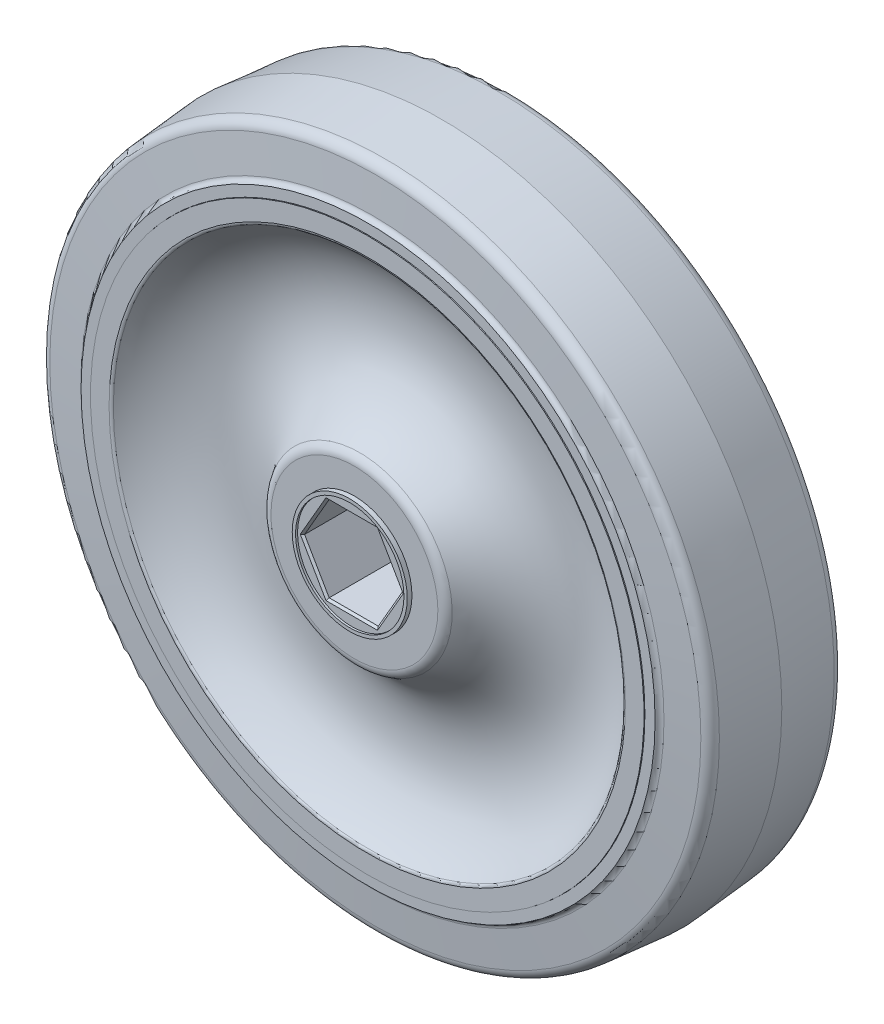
ISO-10303-21;
HEADER;
FILE_DESCRIPTION(('STEP AP214'),'2;1');
FILE_NAME('part.step','',(''),(''),'','','');
FILE_SCHEMA(('AUTOMOTIVE_DESIGN { 1 0 10303 214 1 1 1 1 }'));
ENDSEC;
DATA;
#1=APPLICATION_CONTEXT('core data for automotive mechanical design processes');
#2=APPLICATION_PROTOCOL_DEFINITION('international standard','automotive_design',2000,#1);
#3=PRODUCT_CONTEXT('',#1,'mechanical');
#4=PRODUCT('Part','Part','',(#3));
#5=PRODUCT_RELATED_PRODUCT_CATEGORY('part','',(#4));
#6=PRODUCT_DEFINITION_FORMATION('','',#4);
#7=PRODUCT_DEFINITION_CONTEXT('part definition',#1,'design');
#8=PRODUCT_DEFINITION('design','',#6,#7);
#9=PRODUCT_DEFINITION_SHAPE('','',#8);
#10=(LENGTH_UNIT() NAMED_UNIT(*) SI_UNIT(.MILLI.,.METRE.));
#11=(NAMED_UNIT(*) PLANE_ANGLE_UNIT() SI_UNIT($,.RADIAN.));
#12=(NAMED_UNIT(*) SI_UNIT($,.STERADIAN.) SOLID_ANGLE_UNIT());
#13=UNCERTAINTY_MEASURE_WITH_UNIT(LENGTH_MEASURE(1.E-05),#10,'distance_accuracy_value','');
#14=(GEOMETRIC_REPRESENTATION_CONTEXT(3) GLOBAL_UNCERTAINTY_ASSIGNED_CONTEXT((#13)) GLOBAL_UNIT_ASSIGNED_CONTEXT((#10,
#11,#12)) REPRESENTATION_CONTEXT('',''));
#15=CARTESIAN_POINT('',(0.,0.,0.));
#16=DIRECTION('',(0.,0.,1.));
#17=DIRECTION('',(1.,0.,0.));
#18=AXIS2_PLACEMENT_3D('',#15,#16,#17);
#19=CARTESIAN_POINT('',(0.,0.,10.6679999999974));
#20=DIRECTION('',(0.,0.,-1.));
#21=DIRECTION('',(-1.,0.,0.));
#22=AXIS2_PLACEMENT_3D('',#19,#20,#21);
#23=TOROIDAL_SURFACE('',#22,38.5947886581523,0.507999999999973);
#24=CARTESIAN_POINT('',(0.,0.,10.9557939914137));
#25=DIRECTION('',(0.,0.,-1.));
#26=DIRECTION('',(-1.,0.,0.));
#27=AXIS2_PLACEMENT_3D('',#24,#25,#26);
#28=CIRCLE('',#27,38.1761735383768);
#29=CARTESIAN_POINT('',(-38.1761735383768,0.,10.9557939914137));
#30=VERTEX_POINT('',#29);
#31=EDGE_CURVE('E347',#30,#30,#28,.T.);
#32=ORIENTED_EDGE('',*,*,#31,.T.);
#33=EDGE_LOOP('',(#32));
#34=FACE_BOUND('',#33,.T.);
#35=CARTESIAN_POINT('',(-38.5947886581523,0.,11.1759999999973));
#36=CARTESIAN_POINT('',(-38.5948020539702,-0.631506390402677,11.1759999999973));
#37=CARTESIAN_POINT('',(-38.5792896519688,-1.26301164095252,11.1759999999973));
#38=CARTESIAN_POINT('',(-38.517309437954,-2.52450140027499,11.1759999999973));
#39=CARTESIAN_POINT('',(-38.4708416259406,-3.15448590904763,11.1759999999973));
#40=CARTESIAN_POINT('',(-38.3470467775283,-4.41141572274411,11.1759999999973));
#41=CARTESIAN_POINT('',(-38.2697197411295,-5.03836102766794,11.1759999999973));
#42=CARTESIAN_POINT('',(-38.0843969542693,-6.28770227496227,11.1759999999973));
#43=CARTESIAN_POINT('',(-37.9764012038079,-6.91009821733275,11.1759999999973));
#44=CARTESIAN_POINT('',(-37.7300000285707,-8.14884127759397,11.1759999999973));
#45=CARTESIAN_POINT('',(-37.5915946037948,-8.76518839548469,11.1759999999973));
#46=CARTESIAN_POINT('',(-37.2847078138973,-9.99034898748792,11.1759999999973));
#47=CARTESIAN_POINT('',(-37.1162264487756,-10.5991624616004,11.1759999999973));
#48=CARTESIAN_POINT('',(-36.7495935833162,-11.8077890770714,11.1759999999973));
#49=CARTESIAN_POINT('',(-36.5514420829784,-12.40760221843,11.1759999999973));
#50=CARTESIAN_POINT('',(-36.1259463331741,-13.5967831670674,11.1759999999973));
#51=CARTESIAN_POINT('',(-35.8986020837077,-14.1861509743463,11.1759999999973));
#52=CARTESIAN_POINT('',(-35.4152685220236,-15.3530214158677,11.1759999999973));
#53=CARTESIAN_POINT('',(-35.159279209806,-15.9305240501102,11.1759999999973));
#54=CARTESIAN_POINT('',(-34.6192722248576,-17.0722728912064,11.1759999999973));
#55=CARTESIAN_POINT('',(-34.3352545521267,-17.6365190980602,11.1759999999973));
#56=CARTESIAN_POINT('',(-33.7398750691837,-18.7503957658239,11.1759999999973));
#57=CARTESIAN_POINT('',(-33.4285132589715,-19.3000262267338,11.1759999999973));
#58=CARTESIAN_POINT('',(-32.7791955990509,-20.3833472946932,11.1759999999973));
#59=CARTESIAN_POINT('',(-32.4412397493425,-20.9170379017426,11.1759999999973));
#60=CARTESIAN_POINT('',(-31.7395481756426,-21.9671935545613,11.1759999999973));
#61=CARTESIAN_POINT('',(-31.3758124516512,-22.4836586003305,11.1759999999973));
#62=CARTESIAN_POINT('',(-30.6234374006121,-23.498118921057,11.1759999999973));
#63=CARTESIAN_POINT('',(-30.2347980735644,-23.9961141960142,11.1759999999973));
#64=CARTESIAN_POINT('',(-29.4335520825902,-24.9724352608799,11.1759999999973));
#65=CARTESIAN_POINT('',(-29.0209454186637,-25.4507610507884,11.1759999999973));
#66=CARTESIAN_POINT('',(-28.1727587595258,-26.3865908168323,11.1759999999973));
#67=CARTESIAN_POINT('',(-27.7371787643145,-26.8440947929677,11.1759999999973));
#68=CARTESIAN_POINT('',(-26.8440947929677,-27.7371787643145,11.1759999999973));
#69=CARTESIAN_POINT('',(-26.3865908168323,-28.1727587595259,11.1759999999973));
#70=CARTESIAN_POINT('',(-25.4507610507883,-29.0209454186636,11.1759999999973));
#71=CARTESIAN_POINT('',(-24.9724352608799,-29.4335520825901,11.1759999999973));
#72=CARTESIAN_POINT('',(-23.9961141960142,-30.2347980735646,11.1759999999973));
#73=CARTESIAN_POINT('',(-23.498118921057,-30.6234374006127,11.1759999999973));
#74=CARTESIAN_POINT('',(-22.4836586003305,-31.3758124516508,11.1759999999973));
#75=CARTESIAN_POINT('',(-21.9671935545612,-31.7395481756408,11.1759999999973));
#76=CARTESIAN_POINT('',(-20.9170379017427,-32.4412397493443,11.1759999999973));
#77=CARTESIAN_POINT('',(-20.3833472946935,-32.7791955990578,11.1759999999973));
#78=CARTESIAN_POINT('',(-19.3000262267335,-33.4285132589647,11.1759999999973));
#79=CARTESIAN_POINT('',(-18.7503957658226,-33.7398750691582,11.1759999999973));
#80=CARTESIAN_POINT('',(-17.6365190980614,-34.3352545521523,11.1759999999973));
#81=CARTESIAN_POINT('',(-17.0722728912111,-34.6192722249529,11.1759999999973));
#82=CARTESIAN_POINT('',(-15.9305240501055,-35.1592792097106,11.1759999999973));
#83=CARTESIAN_POINT('',(-15.3530214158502,-35.4152685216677,11.1759999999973));
#84=CARTESIAN_POINT('',(-14.1861509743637,-35.8986020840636,11.1759999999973));
#85=CARTESIAN_POINT('',(-13.5967831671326,-36.1259463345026,11.1759999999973));
#86=CARTESIAN_POINT('',(-12.4076022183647,-36.55144208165,11.1759999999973));
#87=CARTESIAN_POINT('',(-11.8077890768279,-36.7495935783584,11.1759999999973));
#88=CARTESIAN_POINT('',(-10.599162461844,-37.1162264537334,11.1759999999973));
#89=CARTESIAN_POINT('',(-9.99034898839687,-37.2847078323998,11.1759999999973));
#90=CARTESIAN_POINT('',(-8.7651883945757,-37.5915945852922,11.1759999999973));
#91=CARTESIAN_POINT('',(-8.14884127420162,-37.7299999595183,11.1759999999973));
#92=CARTESIAN_POINT('',(-6.91009822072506,-37.9764012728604,11.1759999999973));
#93=CARTESIAN_POINT('',(-6.28770228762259,-38.0843972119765,11.1759999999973));
#94=CARTESIAN_POINT('',(-5.03836101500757,-38.2697194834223,11.1759999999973));
#95=CARTESIAN_POINT('',(-4.41141567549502,-38.3470458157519,11.1759999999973));
#96=CARTESIAN_POINT('',(-3.15448595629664,-38.4708425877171,11.1759999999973));
#97=CARTESIAN_POINT('',(-2.52450157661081,-38.5173130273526,11.1759999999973));
#98=CARTESIAN_POINT('',(-1.26301146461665,-38.5792860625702,11.1759999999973));
#99=CARTESIAN_POINT('',(-0.631505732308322,-38.5947886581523,11.1759999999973));
#100=CARTESIAN_POINT('',(0.631505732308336,-38.5947886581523,11.1759999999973));
#101=CARTESIAN_POINT('',(1.26301146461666,-38.5792860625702,11.1759999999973));
#102=CARTESIAN_POINT('',(2.52450157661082,-38.5173130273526,11.1759999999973));
#103=CARTESIAN_POINT('',(3.15448595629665,-38.4708425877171,11.1759999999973));
#104=CARTESIAN_POINT('',(4.41141567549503,-38.3470458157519,11.1759999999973));
#105=CARTESIAN_POINT('',(5.03836101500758,-38.2697194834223,11.1759999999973));
#106=CARTESIAN_POINT('',(6.2877022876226,-38.0843972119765,11.1759999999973));
#107=CARTESIAN_POINT('',(6.91009822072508,-37.9764012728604,11.1759999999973));
#108=CARTESIAN_POINT('',(8.14884127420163,-37.7299999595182,11.1759999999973));
#109=CARTESIAN_POINT('',(8.76518839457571,-37.5915945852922,11.1759999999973));
#110=CARTESIAN_POINT('',(9.99034898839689,-37.2847078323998,11.1759999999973));
#111=CARTESIAN_POINT('',(10.599162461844,-37.1162264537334,11.1759999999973));
#112=CARTESIAN_POINT('',(11.8077890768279,-36.7495935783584,11.1759999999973));
#113=CARTESIAN_POINT('',(12.4076022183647,-36.5514420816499,11.1759999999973));
#114=CARTESIAN_POINT('',(13.5967831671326,-36.1259463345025,11.1759999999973));
#115=CARTESIAN_POINT('',(14.1861509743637,-35.8986020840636,11.1759999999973));
#116=CARTESIAN_POINT('',(15.3530214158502,-35.4152685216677,11.1759999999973));
#117=CARTESIAN_POINT('',(15.9305240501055,-35.1592792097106,11.1759999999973));
#118=CARTESIAN_POINT('',(17.0722728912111,-34.6192722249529,11.1759999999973));
#119=CARTESIAN_POINT('',(17.6365190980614,-34.3352545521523,11.1759999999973));
#120=CARTESIAN_POINT('',(18.7503957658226,-33.7398750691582,11.1759999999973));
#121=CARTESIAN_POINT('',(19.3000262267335,-33.4285132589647,11.1759999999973));
#122=CARTESIAN_POINT('',(20.3833472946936,-32.7791955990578,11.1759999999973));
#123=CARTESIAN_POINT('',(20.9170379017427,-32.4412397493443,11.1759999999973));
#124=CARTESIAN_POINT('',(21.9671935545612,-31.7395481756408,11.1759999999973));
#125=CARTESIAN_POINT('',(22.4836586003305,-31.3758124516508,11.1759999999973));
#126=CARTESIAN_POINT('',(23.498118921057,-30.6234374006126,11.1759999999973));
#127=CARTESIAN_POINT('',(23.9961141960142,-30.2347980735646,11.1759999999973));
#128=CARTESIAN_POINT('',(24.9724352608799,-29.4335520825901,11.1759999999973));
#129=CARTESIAN_POINT('',(25.4507610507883,-29.0209454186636,11.1759999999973));
#130=CARTESIAN_POINT('',(26.3865908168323,-28.1727587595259,11.1759999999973));
#131=CARTESIAN_POINT('',(26.8440947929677,-27.7371787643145,11.1759999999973));
#132=CARTESIAN_POINT('',(27.7371787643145,-26.8440947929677,11.1759999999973));
#133=CARTESIAN_POINT('',(28.1727587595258,-26.3865908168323,11.1759999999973));
#134=CARTESIAN_POINT('',(29.0209454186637,-25.4507610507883,11.1759999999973));
#135=CARTESIAN_POINT('',(29.4335520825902,-24.9724352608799,11.1759999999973));
#136=CARTESIAN_POINT('',(30.2347980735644,-23.9961141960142,11.1759999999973));
#137=CARTESIAN_POINT('',(30.6234374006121,-23.498118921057,11.1759999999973));
#138=CARTESIAN_POINT('',(31.3758124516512,-22.4836586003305,11.1759999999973));
#139=CARTESIAN_POINT('',(31.7395481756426,-21.9671935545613,11.1759999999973));
#140=CARTESIAN_POINT('',(32.4412397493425,-20.9170379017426,11.1759999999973));
#141=CARTESIAN_POINT('',(32.7791955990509,-20.3833472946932,11.1759999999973));
#142=CARTESIAN_POINT('',(33.4285132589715,-19.3000262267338,11.1759999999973));
#143=CARTESIAN_POINT('',(33.7398750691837,-18.7503957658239,11.1759999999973));
#144=CARTESIAN_POINT('',(34.3352545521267,-17.6365190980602,11.1759999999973));
#145=CARTESIAN_POINT('',(34.6192722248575,-17.0722728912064,11.1759999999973));
#146=CARTESIAN_POINT('',(35.159279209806,-15.9305240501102,11.1759999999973));
#147=CARTESIAN_POINT('',(35.4152685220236,-15.3530214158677,11.1759999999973));
#148=CARTESIAN_POINT('',(35.8986020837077,-14.1861509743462,11.1759999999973));
#149=CARTESIAN_POINT('',(36.1259463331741,-13.5967831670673,11.1759999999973));
#150=CARTESIAN_POINT('',(36.5514420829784,-12.4076022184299,11.1759999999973));
#151=CARTESIAN_POINT('',(36.7495935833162,-11.8077890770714,11.1759999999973));
#152=CARTESIAN_POINT('',(37.1162264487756,-10.5991624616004,11.1759999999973));
#153=CARTESIAN_POINT('',(37.2847078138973,-9.99034898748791,11.1759999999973));
#154=CARTESIAN_POINT('',(37.5915946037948,-8.76518839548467,11.1759999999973));
#155=CARTESIAN_POINT('',(37.7300000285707,-8.14884127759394,11.1759999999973));
#156=CARTESIAN_POINT('',(37.9764012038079,-6.91009821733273,11.1759999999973));
#157=CARTESIAN_POINT('',(38.0843969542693,-6.28770227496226,11.1759999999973));
#158=CARTESIAN_POINT('',(38.2697197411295,-5.03836102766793,11.1759999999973));
#159=CARTESIAN_POINT('',(38.3470467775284,-4.41141572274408,11.1759999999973));
#160=CARTESIAN_POINT('',(38.4708416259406,-3.1544859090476,11.1759999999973));
#161=CARTESIAN_POINT('',(38.517309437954,-2.52450140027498,11.1759999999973));
#162=CARTESIAN_POINT('',(38.5792896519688,-1.26301164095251,11.1759999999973));
#163=CARTESIAN_POINT('',(38.5948020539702,-0.631506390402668,11.1759999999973));
#164=CARTESIAN_POINT('',(38.5947886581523,0.,11.1759999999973));
#165=B_SPLINE_CURVE_WITH_KNOTS('',3,(#35,#36,#37,#38,#39,#40,#41,#42,#43,#44,#45,#46,#47,#48,
#49,#50,#51,#52,#53,#54,#55,#56,#57,#58,#59,#60,#61,#62,#63,#64,#65,#66,#67,#68,#69,#70,#71,#72,
#73,#74,#75,#76,#77,#78,#79,#80,#81,#82,#83,#84,#85,#86,#87,#88,#89,#90,#91,#92,#93,#94,#95,#96,
#97,#98,#99,#100,#101,#102,#103,#104,#105,#106,#107,#108,#109,#110,#111,#112,#113,#114,#115,
#116,#117,#118,#119,#120,#121,#122,#123,#124,#125,#126,#127,#128,#129,#130,#131,#132,#133,#134,
#135,#136,#137,#138,#139,#140,#141,#142,#143,#144,#145,#146,#147,#148,#149,#150,#151,#152,#153,
#154,#155,#156,#157,#158,#159,#160,#161,#162,#163,#164),.UNSPECIFIED.,.F.,.F.,(4,2,2,2,2,2,2,2,
2,2,2,2,2,2,2,2,2,2,2,2,2,2,2,2,2,2,2,2,2,2,2,2,2,2,2,2,2,2,2,2,2,2,2,2,2,2,2,2,2,2,2,2,2,2,2,2,
2,2,2,2,2,2,2,2,4),(0.,1.89432705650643,3.7886541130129,5.68298116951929,7.57730822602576,
9.47163528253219,11.3659623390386,13.2602893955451,15.1546164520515,17.0489435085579,
18.9432705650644,20.8375976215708,22.7319246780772,24.6262517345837,26.5205787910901,
28.4149058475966,30.309232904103,32.2035599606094,34.0978870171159,35.9922140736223,
37.8865411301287,39.7808681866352,41.6751952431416,43.5695222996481,45.4638493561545,
47.3581764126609,49.2525034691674,51.1468305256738,53.0411575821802,54.9354846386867,
56.8298116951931,58.7241387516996,60.618465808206,62.5127928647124,64.4071199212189,
66.3014469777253,68.1957740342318,70.0901010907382,71.9844281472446,73.878755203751,
75.7730822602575,77.6674093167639,79.5617363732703,81.4560634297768,83.3503904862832,
85.2447175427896,87.1390445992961,89.0333716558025,90.927698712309,92.8220257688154,
94.7163528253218,96.6106798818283,98.5050069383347,100.399333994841,102.293661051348,
104.187988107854,106.08231516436,107.976642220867,109.870969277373,111.76529633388,
113.659623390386,115.553950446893,117.448277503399,119.342604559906,121.236931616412),.UNSPECIFIED.);
#166=CARTESIAN_POINT('',(-38.5947886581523,0.,11.1759999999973));
#167=VERTEX_POINT('',#166);
#168=CARTESIAN_POINT('',(38.5947886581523,0.,11.1759999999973));
#169=VERTEX_POINT('',#168);
#170=EDGE_CURVE('E343',#167,#169,#165,.T.);
#171=ORIENTED_EDGE('',*,*,#170,.T.);
#172=CARTESIAN_POINT('',(38.5947886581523,0.,11.1759999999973));
#173=CARTESIAN_POINT('',(38.5948020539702,0.631506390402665,11.1759999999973));
#174=CARTESIAN_POINT('',(38.5792896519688,1.26301164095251,11.1759999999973));
#175=CARTESIAN_POINT('',(38.517309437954,2.52450140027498,11.1759999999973));
#176=CARTESIAN_POINT('',(38.4708416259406,3.15448590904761,11.1759999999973));
#177=CARTESIAN_POINT('',(38.3470467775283,4.41141572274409,11.1759999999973));
#178=CARTESIAN_POINT('',(38.2697197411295,5.03836102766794,11.1759999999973));
#179=CARTESIAN_POINT('',(38.0843969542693,6.28770227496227,11.1759999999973));
#180=CARTESIAN_POINT('',(37.9764012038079,6.91009821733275,11.1759999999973));
#181=CARTESIAN_POINT('',(37.7300000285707,8.14884127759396,11.1759999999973));
#182=CARTESIAN_POINT('',(37.5915946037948,8.76518839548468,11.1759999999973));
#183=CARTESIAN_POINT('',(37.2847078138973,9.99034898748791,11.1759999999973));
#184=CARTESIAN_POINT('',(37.1162264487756,10.5991624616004,11.1759999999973));
#185=CARTESIAN_POINT('',(36.7495935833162,11.8077890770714,11.1759999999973));
#186=CARTESIAN_POINT('',(36.5514420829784,12.4076022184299,11.1759999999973));
#187=CARTESIAN_POINT('',(36.1259463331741,13.5967831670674,11.1759999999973));
#188=CARTESIAN_POINT('',(35.8986020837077,14.1861509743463,11.1759999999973));
#189=CARTESIAN_POINT('',(35.4152685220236,15.3530214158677,11.1759999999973));
#190=CARTESIAN_POINT('',(35.159279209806,15.9305240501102,11.1759999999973));
#191=CARTESIAN_POINT('',(34.6192722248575,17.0722728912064,11.1759999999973));
#192=CARTESIAN_POINT('',(34.3352545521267,17.6365190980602,11.1759999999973));
#193=CARTESIAN_POINT('',(33.7398750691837,18.7503957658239,11.1759999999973));
#194=CARTESIAN_POINT('',(33.4285132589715,19.3000262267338,11.1759999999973));
#195=CARTESIAN_POINT('',(32.7791955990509,20.3833472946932,11.1759999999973));
#196=CARTESIAN_POINT('',(32.4412397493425,20.9170379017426,11.1759999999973));
#197=CARTESIAN_POINT('',(31.7395481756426,21.9671935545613,11.1759999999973));
#198=CARTESIAN_POINT('',(31.3758124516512,22.4836586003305,11.1759999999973));
#199=CARTESIAN_POINT('',(30.6234374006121,23.498118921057,11.1759999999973));
#200=CARTESIAN_POINT('',(30.2347980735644,23.9961141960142,11.1759999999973));
#201=CARTESIAN_POINT('',(29.4335520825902,24.9724352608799,11.1759999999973));
#202=CARTESIAN_POINT('',(29.0209454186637,25.4507610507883,11.1759999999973));
#203=CARTESIAN_POINT('',(28.1727587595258,26.3865908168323,11.1759999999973));
#204=CARTESIAN_POINT('',(27.7371787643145,26.8440947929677,11.1759999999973));
#205=CARTESIAN_POINT('',(26.8440947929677,27.7371787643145,11.1759999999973));
#206=CARTESIAN_POINT('',(26.3865908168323,28.1727587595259,11.1759999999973));
#207=CARTESIAN_POINT('',(25.4507610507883,29.0209454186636,11.1759999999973));
#208=CARTESIAN_POINT('',(24.9724352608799,29.4335520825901,11.1759999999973));
#209=CARTESIAN_POINT('',(23.9961141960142,30.2347980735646,11.1759999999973));
#210=CARTESIAN_POINT('',(23.498118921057,30.6234374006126,11.1759999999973));
#211=CARTESIAN_POINT('',(22.4836586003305,31.3758124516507,11.1759999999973));
#212=CARTESIAN_POINT('',(21.9671935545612,31.7395481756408,11.1759999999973));
#213=CARTESIAN_POINT('',(20.9170379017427,32.4412397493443,11.1759999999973));
#214=CARTESIAN_POINT('',(20.3833472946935,32.7791955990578,11.1759999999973));
#215=CARTESIAN_POINT('',(19.3000262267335,33.4285132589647,11.1759999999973));
#216=CARTESIAN_POINT('',(18.7503957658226,33.7398750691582,11.1759999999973));
#217=CARTESIAN_POINT('',(17.6365190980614,34.3352545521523,11.1759999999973));
#218=CARTESIAN_POINT('',(17.0722728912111,34.6192722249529,11.1759999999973));
#219=CARTESIAN_POINT('',(15.9305240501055,35.1592792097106,11.1759999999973));
#220=CARTESIAN_POINT('',(15.3530214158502,35.4152685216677,11.1759999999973));
#221=CARTESIAN_POINT('',(14.1861509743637,35.8986020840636,11.1759999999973));
#222=CARTESIAN_POINT('',(13.5967831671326,36.1259463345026,11.1759999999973));
#223=CARTESIAN_POINT('',(12.4076022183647,36.5514420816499,11.1759999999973));
#224=CARTESIAN_POINT('',(11.8077890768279,36.7495935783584,11.1759999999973));
#225=CARTESIAN_POINT('',(10.599162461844,37.1162264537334,11.1759999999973));
#226=CARTESIAN_POINT('',(9.99034898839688,37.2847078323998,11.1759999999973));
#227=CARTESIAN_POINT('',(8.7651883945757,37.5915945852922,11.1759999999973));
#228=CARTESIAN_POINT('',(8.14884127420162,37.7299999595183,11.1759999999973));
#229=CARTESIAN_POINT('',(6.91009822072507,37.9764012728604,11.1759999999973));
#230=CARTESIAN_POINT('',(6.2877022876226,38.0843972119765,11.1759999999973));
#231=CARTESIAN_POINT('',(5.03836101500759,38.2697194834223,11.1759999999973));
#232=CARTESIAN_POINT('',(4.41141567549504,38.3470458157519,11.1759999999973));
#233=CARTESIAN_POINT('',(3.15448595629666,38.4708425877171,11.1759999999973));
#234=CARTESIAN_POINT('',(2.52450157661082,38.5173130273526,11.1759999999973));
#235=CARTESIAN_POINT('',(1.26301146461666,38.5792860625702,11.1759999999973));
#236=CARTESIAN_POINT('',(0.631505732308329,38.5947886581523,11.1759999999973));
#237=CARTESIAN_POINT('',(-0.631505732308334,38.5947886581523,11.1759999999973));
#238=CARTESIAN_POINT('',(-1.26301146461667,38.5792860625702,11.1759999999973));
#239=CARTESIAN_POINT('',(-2.52450157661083,38.5173130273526,11.1759999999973));
#240=CARTESIAN_POINT('',(-3.15448595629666,38.4708425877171,11.1759999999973));
#241=CARTESIAN_POINT('',(-4.41141567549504,38.3470458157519,11.1759999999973));
#242=CARTESIAN_POINT('',(-5.03836101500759,38.2697194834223,11.1759999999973));
#243=CARTESIAN_POINT('',(-6.28770228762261,38.0843972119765,11.1759999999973));
#244=CARTESIAN_POINT('',(-6.91009822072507,37.9764012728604,11.1759999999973));
#245=CARTESIAN_POINT('',(-8.14884127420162,37.7299999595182,11.1759999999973));
#246=CARTESIAN_POINT('',(-8.76518839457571,37.5915945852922,11.1759999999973));
#247=CARTESIAN_POINT('',(-9.99034898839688,37.2847078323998,11.1759999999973));
#248=CARTESIAN_POINT('',(-10.599162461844,37.1162264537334,11.1759999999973));
#249=CARTESIAN_POINT('',(-11.8077890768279,36.7495935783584,11.1759999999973));
#250=CARTESIAN_POINT('',(-12.4076022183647,36.5514420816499,11.1759999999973));
#251=CARTESIAN_POINT('',(-13.5967831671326,36.1259463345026,11.1759999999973));
#252=CARTESIAN_POINT('',(-14.1861509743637,35.8986020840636,11.1759999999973));
#253=CARTESIAN_POINT('',(-15.3530214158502,35.4152685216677,11.1759999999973));
#254=CARTESIAN_POINT('',(-15.9305240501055,35.1592792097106,11.1759999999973));
#255=CARTESIAN_POINT('',(-17.0722728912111,34.6192722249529,11.1759999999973));
#256=CARTESIAN_POINT('',(-17.6365190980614,34.3352545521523,11.1759999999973));
#257=CARTESIAN_POINT('',(-18.7503957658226,33.7398750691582,11.1759999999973));
#258=CARTESIAN_POINT('',(-19.3000262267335,33.4285132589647,11.1759999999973));
#259=CARTESIAN_POINT('',(-20.3833472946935,32.7791955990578,11.1759999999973));
#260=CARTESIAN_POINT('',(-20.9170379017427,32.4412397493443,11.1759999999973));
#261=CARTESIAN_POINT('',(-21.9671935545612,31.7395481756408,11.1759999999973));
#262=CARTESIAN_POINT('',(-22.4836586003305,31.3758124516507,11.1759999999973));
#263=CARTESIAN_POINT('',(-23.498118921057,30.6234374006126,11.1759999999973));
#264=CARTESIAN_POINT('',(-23.9961141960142,30.2347980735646,11.1759999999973));
#265=CARTESIAN_POINT('',(-24.9724352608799,29.4335520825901,11.1759999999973));
#266=CARTESIAN_POINT('',(-25.4507610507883,29.0209454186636,11.1759999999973));
#267=CARTESIAN_POINT('',(-26.3865908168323,28.1727587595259,11.1759999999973));
#268=CARTESIAN_POINT('',(-26.8440947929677,27.7371787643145,11.1759999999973));
#269=CARTESIAN_POINT('',(-27.7371787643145,26.8440947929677,11.1759999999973));
#270=CARTESIAN_POINT('',(-28.1727587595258,26.3865908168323,11.1759999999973));
#271=CARTESIAN_POINT('',(-29.0209454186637,25.4507610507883,11.1759999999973));
#272=CARTESIAN_POINT('',(-29.4335520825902,24.9724352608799,11.1759999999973));
#273=CARTESIAN_POINT('',(-30.2347980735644,23.9961141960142,11.1759999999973));
#274=CARTESIAN_POINT('',(-30.6234374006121,23.498118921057,11.1759999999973));
#275=CARTESIAN_POINT('',(-31.3758124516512,22.4836586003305,11.1759999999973));
#276=CARTESIAN_POINT('',(-31.7395481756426,21.9671935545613,11.1759999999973));
#277=CARTESIAN_POINT('',(-32.4412397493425,20.9170379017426,11.1759999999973));
#278=CARTESIAN_POINT('',(-32.7791955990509,20.3833472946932,11.1759999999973));
#279=CARTESIAN_POINT('',(-33.4285132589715,19.3000262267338,11.1759999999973));
#280=CARTESIAN_POINT('',(-33.7398750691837,18.7503957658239,11.1759999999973));
#281=CARTESIAN_POINT('',(-34.3352545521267,17.6365190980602,11.1759999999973));
#282=CARTESIAN_POINT('',(-34.6192722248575,17.0722728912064,11.1759999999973));
#283=CARTESIAN_POINT('',(-35.159279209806,15.9305240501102,11.1759999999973));
#284=CARTESIAN_POINT('',(-35.4152685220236,15.3530214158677,11.1759999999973));
#285=CARTESIAN_POINT('',(-35.8986020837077,14.1861509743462,11.1759999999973));
#286=CARTESIAN_POINT('',(-36.1259463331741,13.5967831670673,11.1759999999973));
#287=CARTESIAN_POINT('',(-36.5514420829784,12.4076022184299,11.1759999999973));
#288=CARTESIAN_POINT('',(-36.7495935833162,11.8077890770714,11.1759999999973));
#289=CARTESIAN_POINT('',(-37.1162264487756,10.5991624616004,11.1759999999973));
#290=CARTESIAN_POINT('',(-37.2847078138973,9.99034898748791,11.1759999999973));
#291=CARTESIAN_POINT('',(-37.5915946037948,8.76518839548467,11.1759999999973));
#292=CARTESIAN_POINT('',(-37.7300000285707,8.14884127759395,11.1759999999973));
#293=CARTESIAN_POINT('',(-37.9764012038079,6.91009821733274,11.1759999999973));
#294=CARTESIAN_POINT('',(-38.0843969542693,6.28770227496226,11.1759999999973));
#295=CARTESIAN_POINT('',(-38.2697197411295,5.03836102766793,11.1759999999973));
#296=CARTESIAN_POINT('',(-38.3470467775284,4.41141572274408,11.1759999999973));
#297=CARTESIAN_POINT('',(-38.4708416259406,3.15448590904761,11.1759999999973));
#298=CARTESIAN_POINT('',(-38.517309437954,2.52450140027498,11.1759999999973));
#299=CARTESIAN_POINT('',(-38.5792896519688,1.26301164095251,11.1759999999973));
#300=CARTESIAN_POINT('',(-38.5948020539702,0.631506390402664,11.1759999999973));
#301=CARTESIAN_POINT('',(-38.5947886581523,0.,11.1759999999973));
#302=B_SPLINE_CURVE_WITH_KNOTS('',3,(#172,#173,#174,#175,#176,#177,#178,#179,#180,#181,#182,
#183,#184,#185,#186,#187,#188,#189,#190,#191,#192,#193,#194,#195,#196,#197,#198,#199,#200,#201,
#202,#203,#204,#205,#206,#207,#208,#209,#210,#211,#212,#213,#214,#215,#216,#217,#218,#219,#220,
#221,#222,#223,#224,#225,#226,#227,#228,#229,#230,#231,#232,#233,#234,#235,#236,#237,#238,#239,
#240,#241,#242,#243,#244,#245,#246,#247,#248,#249,#250,#251,#252,#253,#254,#255,#256,#257,#258,
#259,#260,#261,#262,#263,#264,#265,#266,#267,#268,#269,#270,#271,#272,#273,#274,#275,#276,#277,
#278,#279,#280,#281,#282,#283,#284,#285,#286,#287,#288,#289,#290,#291,#292,#293,#294,#295,#296,
#297,#298,#299,#300,#301),.UNSPECIFIED.,.F.,.F.,(4,2,2,2,2,2,2,2,2,2,2,2,2,2,2,2,2,2,2,2,2,2,2,
2,2,2,2,2,2,2,2,2,2,2,2,2,2,2,2,2,2,2,2,2,2,2,2,2,2,2,2,2,2,2,2,2,2,2,2,2,2,2,2,2,4),(0.,
1.89432705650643,3.78865411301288,5.68298116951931,7.57730822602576,9.47163528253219,
11.3659623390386,13.2602893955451,15.1546164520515,17.0489435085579,18.9432705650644,
20.8375976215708,22.7319246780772,24.6262517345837,26.5205787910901,28.4149058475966,
30.309232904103,32.2035599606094,34.0978870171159,35.9922140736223,37.8865411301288,
39.7808681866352,41.6751952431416,43.5695222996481,45.4638493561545,47.3581764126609,
49.2525034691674,51.1468305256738,53.0411575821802,54.9354846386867,56.8298116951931,
58.7241387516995,60.618465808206,62.5127928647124,64.4071199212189,66.3014469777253,
68.1957740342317,70.0901010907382,71.9844281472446,73.878755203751,75.7730822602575,
77.6674093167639,79.5617363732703,81.4560634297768,83.3503904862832,85.2447175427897,
87.1390445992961,89.0333716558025,90.927698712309,92.8220257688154,94.7163528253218,
96.6106798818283,98.5050069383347,100.399333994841,102.293661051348,104.187988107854,
106.08231516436,107.976642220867,109.870969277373,111.76529633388,113.659623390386,
115.553950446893,117.448277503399,119.342604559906,121.236931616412),.UNSPECIFIED.);
#303=EDGE_CURVE('E332',#169,#167,#302,.T.);
#304=ORIENTED_EDGE('',*,*,#303,.T.);
#305=EDGE_LOOP('',(#171,#304));
#306=FACE_BOUND('',#305,.T.);
#307=ADVANCED_FACE('F18',(#34,#306),#23,.T.);
#308=CARTESIAN_POINT('',(0.,38.3245686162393,11.1759999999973));
#309=DIRECTION('',(0.,0.,-1.));
#310=DIRECTION('',(-1.,0.,0.));
#311=AXIS2_PLACEMENT_3D('',#308,#309,#310);
#312=PLANE('',#311);
#313=ORIENTED_EDGE('',*,*,#303,.F.);
#314=ORIENTED_EDGE('',*,*,#170,.F.);
#315=EDGE_LOOP('',(#313,#314));
#316=FACE_BOUND('',#315,.T.);
#317=CARTESIAN_POINT('',(0.,0.,11.1759999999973));
#318=DIRECTION('',(0.,0.,-1.));
#319=DIRECTION('',(-1.,0.,0.));
#320=AXIS2_PLACEMENT_3D('',#317,#318,#319);
#321=CIRCLE('',#320,41.3736895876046);
#322=CARTESIAN_POINT('',(0.,-41.3736895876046,11.1759999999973));
#323=VERTEX_POINT('',#322);
#324=CARTESIAN_POINT('',(0.,41.3736895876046,11.1759999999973));
#325=VERTEX_POINT('',#324);
#326=EDGE_CURVE('E328',#323,#325,#321,.T.);
#327=ORIENTED_EDGE('',*,*,#326,.F.);
#328=CARTESIAN_POINT('',(0.,0.,11.1759999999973));
#329=DIRECTION('',(0.,0.,-1.));
#330=DIRECTION('',(-1.,0.,0.));
#331=AXIS2_PLACEMENT_3D('',#328,#329,#330);
#332=CIRCLE('',#331,41.3736895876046);
#333=EDGE_CURVE('E22',#325,#323,#332,.T.);
#334=ORIENTED_EDGE('',*,*,#333,.F.);
#335=EDGE_LOOP('',(#327,#334));
#336=FACE_BOUND('',#335,.T.);
#337=ADVANCED_FACE('F304',(#316,#336),#312,.F.);
#338=CARTESIAN_POINT('',(0.,0.,19.05));
#339=DIRECTION('',(0.,0.,-1.));
#340=DIRECTION('',(0.,1.,0.));
#341=AXIS2_PLACEMENT_3D('',#338,#339,#340);
#342=TOROIDAL_SURFACE('',#341,26.4026232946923,14.2875);
#343=CARTESIAN_POINT('',(0.,0.,12.2906927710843));
#344=DIRECTION('',(0.,0.,1.));
#345=DIRECTION('',(0.,-1.,0.));
#346=AXIS2_PLACEMENT_3D('',#343,#344,#345);
#347=CIRCLE('',#346,13.8151524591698);
#348=CARTESIAN_POINT('',(0.,-13.8151524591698,12.2906927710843));
#349=VERTEX_POINT('',#348);
#350=EDGE_CURVE('E320',#349,#349,#347,.T.);
#351=ORIENTED_EDGE('',*,*,#350,.F.);
#352=EDGE_LOOP('',(#351));
#353=FACE_BOUND('',#352,.T.);
#354=ORIENTED_EDGE('',*,*,#31,.F.);
#355=EDGE_LOOP('',(#354));
#356=FACE_BOUND('',#355,.T.);
#357=ADVANCED_FACE('F269',(#353,#356),#342,.F.);
#358=CARTESIAN_POINT('',(0.,0.,6.34999999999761));
#359=DIRECTION('',(0.,0.,-1.));
#360=DIRECTION('',(-1.,0.,0.));
#361=AXIS2_PLACEMENT_3D('',#358,#359,#360);
#362=CONICAL_SURFACE('',#361,41.6266095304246,0.0523598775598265);
#363=ORIENTED_EDGE('',*,*,#333,.T.);
#364=ORIENTED_EDGE('',*,*,#326,.T.);
#365=EDGE_LOOP('',(#363,#364));
#366=FACE_BOUND('',#365,.T.);
#367=CARTESIAN_POINT('',(0.,0.,6.34999999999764));
#368=DIRECTION('',(0.,0.,1.));
#369=DIRECTION('',(-1.,0.,0.));
#370=AXIS2_PLACEMENT_3D('',#367,#368,#369);
#371=CIRCLE('',#370,41.6266095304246);
#372=CARTESIAN_POINT('',(-41.6286047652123,0.,6.3499999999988));
#373=VERTEX_POINT('',#372);
#374=CARTESIAN_POINT('',(0.,-41.6286047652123,6.3499999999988));
#375=VERTEX_POINT('',#374);
#376=EDGE_CURVE('E613',#373,#375,#371,.T.);
#377=ORIENTED_EDGE('',*,*,#376,.T.);
#378=CARTESIAN_POINT('',(0.,0.,6.34999999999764));
#379=DIRECTION('',(0.,0.,1.));
#380=DIRECTION('',(0.,-1.,0.));
#381=AXIS2_PLACEMENT_3D('',#378,#379,#380);
#382=CIRCLE('',#381,41.6266095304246);
#383=CARTESIAN_POINT('',(41.6286047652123,0.,6.3499999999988));
#384=VERTEX_POINT('',#383);
#385=EDGE_CURVE('E239',#375,#384,#382,.T.);
#386=ORIENTED_EDGE('',*,*,#385,.T.);
#387=CARTESIAN_POINT('',(0.,0.,6.34999999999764));
#388=DIRECTION('',(0.,0.,1.));
#389=DIRECTION('',(1.,0.,0.));
#390=AXIS2_PLACEMENT_3D('',#387,#388,#389);
#391=CIRCLE('',#390,41.6266095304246);
#392=CARTESIAN_POINT('',(0.,41.6286047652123,6.3499999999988));
#393=VERTEX_POINT('',#392);
#394=EDGE_CURVE('E286',#384,#393,#391,.T.);
#395=ORIENTED_EDGE('',*,*,#394,.T.);
#396=CARTESIAN_POINT('',(0.,0.,6.34999999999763));
#397=DIRECTION('',(0.,0.,1.));
#398=DIRECTION('',(0.,1.,0.));
#399=AXIS2_PLACEMENT_3D('',#396,#397,#398);
#400=CIRCLE('',#399,41.6266095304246);
#401=EDGE_CURVE('E37',#393,#373,#400,.T.);
#402=ORIENTED_EDGE('',*,*,#401,.T.);
#403=EDGE_LOOP('',(#377,#386,#395,#402));
#404=FACE_BOUND('',#403,.T.);
#405=ADVANCED_FACE('F267',(#366,#404),#362,.T.);
#406=CARTESIAN_POINT('',(0.,0.,11.5697));
#407=DIRECTION('',(0.,0.,1.));
#408=DIRECTION('',(1.,0.,0.));
#409=AXIS2_PLACEMENT_3D('',#406,#407,#408);
#410=TOROIDAL_SURFACE('',#409,12.4724889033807,1.52400000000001);
#411=ORIENTED_EDGE('',*,*,#350,.T.);
#412=EDGE_LOOP('',(#411));
#413=FACE_BOUND('',#412,.T.);
#414=CARTESIAN_POINT('',(12.4724889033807,0.,13.0937));
#415=CARTESIAN_POINT('',(12.4724932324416,-0.204080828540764,13.0937));
#416=CARTESIAN_POINT('',(12.4674801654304,-0.408161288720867,13.0937));
#417=CARTESIAN_POINT('',(12.4474503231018,-0.815830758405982,13.0937));
#418=CARTESIAN_POINT('',(12.4324335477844,-1.01941976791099,13.0937));
#419=CARTESIAN_POINT('',(12.3924273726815,-1.42561562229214,13.0937));
#420=CARTESIAN_POINT('',(12.367437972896,-1.62822246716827,13.0937));
#421=CARTESIAN_POINT('',(12.3075481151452,-2.03196596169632,13.0937));
#422=CARTESIAN_POINT('',(12.27264765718,-2.23310261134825,13.0937));
#423=CARTESIAN_POINT('',(12.1930193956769,-2.63342114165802,13.0937));
#424=CARTESIAN_POINT('',(12.1482915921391,-2.83260302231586,13.0937));
#425=CARTESIAN_POINT('',(12.0491164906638,-3.22853217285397,13.0937));
#426=CARTESIAN_POINT('',(11.9946691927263,-3.42527944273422,13.0937));
#427=CARTESIAN_POINT('',(11.8761862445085,-3.81586538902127,13.0937));
#428=CARTESIAN_POINT('',(11.8121505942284,-4.00970406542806,13.0937));
#429=CARTESIAN_POINT('',(11.6746452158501,-4.39400585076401,13.0937));
#430=CARTESIAN_POINT('',(11.601175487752,-4.58446895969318,13.0937));
#431=CARTESIAN_POINT('',(11.4449789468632,-4.9615607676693,13.0937));
#432=CARTESIAN_POINT('',(11.3622521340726,-5.14818946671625,13.0937));
#433=CARTESIAN_POINT('',(11.1877407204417,-5.51716285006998,13.0937));
#434=CARTESIAN_POINT('',(11.0959561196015,-5.69950753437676,13.0937));
#435=CARTESIAN_POINT('',(10.9035502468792,-6.05947360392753,13.0937));
#436=CARTESIAN_POINT('',(10.802928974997,-6.23709498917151,13.0937));
#437=CARTESIAN_POINT('',(10.5930921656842,-6.58718655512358,13.0937));
#438=CARTESIAN_POINT('',(10.4838766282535,-6.75965673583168,13.0937));
#439=CARTESIAN_POINT('',(10.25711439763,-7.09903039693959,13.0937));
#440=CARTESIAN_POINT('',(10.1395677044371,-7.26593387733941,13.0937));
#441=CARTESIAN_POINT('',(9.89642634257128,-7.59377205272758,13.0937));
#442=CARTESIAN_POINT('',(9.77083167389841,-7.75470674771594,13.0937));
#443=CARTESIAN_POINT('',(9.51189692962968,-8.07021964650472,13.0937));
#444=CARTESIAN_POINT('',(9.37855685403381,-8.22479785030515,13.0937));
#445=CARTESIAN_POINT('',(9.10445252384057,-8.52722537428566,13.0937));
#446=CARTESIAN_POINT('',(8.96368826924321,-8.67507469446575,13.0937));
#447=CARTESIAN_POINT('',(8.67507469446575,-8.96368826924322,13.0937));
#448=CARTESIAN_POINT('',(8.52722537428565,-9.10445252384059,13.0937));
#449=CARTESIAN_POINT('',(8.22479785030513,-9.37855685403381,13.0937));
#450=CARTESIAN_POINT('',(8.07021964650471,-9.51189692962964,13.0937));
#451=CARTESIAN_POINT('',(7.75470674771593,-9.77083167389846,13.0937));
#452=CARTESIAN_POINT('',(7.59377205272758,-9.89642634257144,13.0937));
#453=CARTESIAN_POINT('',(7.2659338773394,-10.1395677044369,13.0937));
#454=CARTESIAN_POINT('',(7.09903039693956,-10.2571143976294,13.0937));
#455=CARTESIAN_POINT('',(6.7596567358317,-10.4838766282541,13.0937));
#456=CARTESIAN_POINT('',(6.58718655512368,-10.5930921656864,13.0937));
#457=CARTESIAN_POINT('',(6.23709498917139,-10.8029289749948,13.0937));
#458=CARTESIAN_POINT('',(6.05947360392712,-10.9035502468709,13.0937));
#459=CARTESIAN_POINT('',(5.69950753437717,-11.0959561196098,13.0937));
#460=CARTESIAN_POINT('',(5.51716285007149,-11.1877407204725,13.0937));
#461=CARTESIAN_POINT('',(5.14818946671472,-11.3622521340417,13.0937));
#462=CARTESIAN_POINT('',(4.96156076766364,-11.4449789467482,13.0937));
#463=CARTESIAN_POINT('',(4.58446895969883,-11.601175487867,13.0937));
#464=CARTESIAN_POINT('',(4.3940058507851,-11.6746452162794,13.0937));
#465=CARTESIAN_POINT('',(4.00970406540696,-11.812150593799,13.0937));
#466=CARTESIAN_POINT('',(3.81586538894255,-11.8761862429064,13.0937));
#467=CARTESIAN_POINT('',(3.42527944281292,-11.9946691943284,13.0937));
#468=CARTESIAN_POINT('',(3.22853217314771,-12.0491164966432,13.0937));
#469=CARTESIAN_POINT('',(2.83260302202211,-12.1482915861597,13.0937));
#470=CARTESIAN_POINT('',(2.63342114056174,-12.1930193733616,13.0937));
#471=CARTESIAN_POINT('',(2.23310261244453,-12.2726476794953,13.0937));
#472=CARTESIAN_POINT('',(2.0319659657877,-12.3075481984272,13.0937));
#473=CARTESIAN_POINT('',(1.62822246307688,-12.367437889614,13.0937));
#474=CARTESIAN_POINT('',(1.42561560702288,-12.3924270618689,13.0937));
#475=CARTESIAN_POINT('',(1.01941978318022,-12.432433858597,13.0937));
#476=CARTESIAN_POINT('',(0.815830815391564,-12.4474514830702,13.0937));
#477=CARTESIAN_POINT('',(0.408161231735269,-12.467479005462,13.0937));
#478=CARTESIAN_POINT('',(0.204080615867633,-12.4724889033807,13.0937));
#479=CARTESIAN_POINT('',(-0.204080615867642,-12.4724889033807,13.0937));
#480=CARTESIAN_POINT('',(-0.408161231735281,-12.467479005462,13.0937));
#481=CARTESIAN_POINT('',(-0.81583081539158,-12.4474514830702,13.0937));
#482=CARTESIAN_POINT('',(-1.01941978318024,-12.432433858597,13.0937));
#483=CARTESIAN_POINT('',(-1.42561560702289,-12.3924270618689,13.0937));
#484=CARTESIAN_POINT('',(-1.62822246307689,-12.367437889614,13.0937));
#485=CARTESIAN_POINT('',(-2.03196596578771,-12.3075481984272,13.0937));
#486=CARTESIAN_POINT('',(-2.23310261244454,-12.2726476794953,13.0937));
#487=CARTESIAN_POINT('',(-2.63342114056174,-12.1930193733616,13.0937));
#488=CARTESIAN_POINT('',(-2.83260302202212,-12.1482915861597,13.0937));
#489=CARTESIAN_POINT('',(-3.22853217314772,-12.0491164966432,13.0937));
#490=CARTESIAN_POINT('',(-3.42527944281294,-11.9946691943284,13.0937));
#491=CARTESIAN_POINT('',(-3.81586538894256,-11.8761862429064,13.0937));
#492=CARTESIAN_POINT('',(-4.00970406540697,-11.812150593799,13.0937));
#493=CARTESIAN_POINT('',(-4.3940058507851,-11.6746452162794,13.0937));
#494=CARTESIAN_POINT('',(-4.58446895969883,-11.601175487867,13.0937));
#495=CARTESIAN_POINT('',(-4.96156076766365,-11.4449789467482,13.0937));
#496=CARTESIAN_POINT('',(-5.14818946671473,-11.3622521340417,13.0937));
#497=CARTESIAN_POINT('',(-5.51716285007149,-11.1877407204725,13.0937));
#498=CARTESIAN_POINT('',(-5.69950753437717,-11.0959561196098,13.0937));
#499=CARTESIAN_POINT('',(-6.05947360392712,-10.9035502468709,13.0937));
#500=CARTESIAN_POINT('',(-6.2370949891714,-10.8029289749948,13.0937));
#501=CARTESIAN_POINT('',(-6.58718655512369,-10.5930921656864,13.0937));
#502=CARTESIAN_POINT('',(-6.75965673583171,-10.4838766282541,13.0937));
#503=CARTESIAN_POINT('',(-7.09903039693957,-10.2571143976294,13.0937));
#504=CARTESIAN_POINT('',(-7.2659338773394,-10.1395677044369,13.0937));
#505=CARTESIAN_POINT('',(-7.59377205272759,-9.89642634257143,13.0937));
#506=CARTESIAN_POINT('',(-7.75470674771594,-9.77083167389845,13.0937));
#507=CARTESIAN_POINT('',(-8.07021964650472,-9.51189692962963,13.0937));
#508=CARTESIAN_POINT('',(-8.22479785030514,-9.3785568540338,13.0937));
#509=CARTESIAN_POINT('',(-8.52722537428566,-9.10445252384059,13.0937));
#510=CARTESIAN_POINT('',(-8.67507469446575,-8.96368826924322,13.0937));
#511=CARTESIAN_POINT('',(-8.96368826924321,-8.67507469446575,13.0937));
#512=CARTESIAN_POINT('',(-9.10445252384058,-8.52722537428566,13.0937));
#513=CARTESIAN_POINT('',(-9.37855685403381,-8.22479785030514,13.0937));
#514=CARTESIAN_POINT('',(-9.51189692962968,-8.07021964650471,13.0937));
#515=CARTESIAN_POINT('',(-9.77083167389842,-7.75470674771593,13.0937));
#516=CARTESIAN_POINT('',(-9.89642634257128,-7.59377205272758,13.0937));
#517=CARTESIAN_POINT('',(-10.1395677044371,-7.26593387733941,13.0937));
#518=CARTESIAN_POINT('',(-10.25711439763,-7.09903039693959,13.0937));
#519=CARTESIAN_POINT('',(-10.4838766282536,-6.75965673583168,13.0937));
#520=CARTESIAN_POINT('',(-10.5930921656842,-6.58718655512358,13.0937));
#521=CARTESIAN_POINT('',(-10.802928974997,-6.2370949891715,13.0937));
#522=CARTESIAN_POINT('',(-10.9035502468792,-6.05947360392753,13.0937));
#523=CARTESIAN_POINT('',(-11.0959561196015,-5.69950753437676,13.0937));
#524=CARTESIAN_POINT('',(-11.1877407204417,-5.51716285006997,13.0937));
#525=CARTESIAN_POINT('',(-11.3622521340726,-5.14818946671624,13.0937));
#526=CARTESIAN_POINT('',(-11.4449789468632,-4.96156076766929,13.0937));
#527=CARTESIAN_POINT('',(-11.601175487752,-4.58446895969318,13.0937));
#528=CARTESIAN_POINT('',(-11.6746452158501,-4.394005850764,13.0937));
#529=CARTESIAN_POINT('',(-11.8121505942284,-4.00970406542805,13.0937));
#530=CARTESIAN_POINT('',(-11.8761862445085,-3.81586538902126,13.0937));
#531=CARTESIAN_POINT('',(-11.9946691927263,-3.42527944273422,13.0937));
#532=CARTESIAN_POINT('',(-12.0491164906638,-3.22853217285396,13.0937));
#533=CARTESIAN_POINT('',(-12.1482915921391,-2.83260302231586,13.0937));
#534=CARTESIAN_POINT('',(-12.1930193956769,-2.63342114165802,13.0937));
#535=CARTESIAN_POINT('',(-12.27264765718,-2.23310261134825,13.0937));
#536=CARTESIAN_POINT('',(-12.3075481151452,-2.03196596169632,13.0937));
#537=CARTESIAN_POINT('',(-12.367437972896,-1.62822246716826,13.0937));
#538=CARTESIAN_POINT('',(-12.3924273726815,-1.42561562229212,13.0937));
#539=CARTESIAN_POINT('',(-12.4324335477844,-1.01941976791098,13.0937));
#540=CARTESIAN_POINT('',(-12.4474503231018,-0.815830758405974,13.0937));
#541=CARTESIAN_POINT('',(-12.4674801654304,-0.408161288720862,13.0937));
#542=CARTESIAN_POINT('',(-12.4724932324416,-0.204080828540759,13.0937));
#543=CARTESIAN_POINT('',(-12.4724889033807,0.,13.0937));
#544=B_SPLINE_CURVE_WITH_KNOTS('',3,(#414,#415,#416,#417,#418,#419,#420,#421,#422,#423,#424,
#425,#426,#427,#428,#429,#430,#431,#432,#433,#434,#435,#436,#437,#438,#439,#440,#441,#442,#443,
#444,#445,#446,#447,#448,#449,#450,#451,#452,#453,#454,#455,#456,#457,#458,#459,#460,#461,#462,
#463,#464,#465,#466,#467,#468,#469,#470,#471,#472,#473,#474,#475,#476,#477,#478,#479,#480,#481,
#482,#483,#484,#485,#486,#487,#488,#489,#490,#491,#492,#493,#494,#495,#496,#497,#498,#499,#500,
#501,#502,#503,#504,#505,#506,#507,#508,#509,#510,#511,#512,#513,#514,#515,#516,#517,#518,#519,
#520,#521,#522,#523,#524,#525,#526,#527,#528,#529,#530,#531,#532,#533,#534,#535,#536,#537,#538,
#539,#540,#541,#542,#543),.UNSPECIFIED.,.F.,.F.,(4,2,2,2,2,2,2,2,2,2,2,2,2,2,2,2,2,2,2,2,2,2,2,
2,2,2,2,2,2,2,2,2,2,2,2,2,2,2,2,2,2,2,2,2,2,2,2,2,2,2,2,2,2,2,2,2,2,2,2,2,2,2,2,2,4),(0.,
0.612180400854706,1.22436080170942,1.83654120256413,2.44872160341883,3.06090200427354,
3.67308240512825,4.28526280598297,4.89744320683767,5.50962360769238,6.12180400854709,
6.73398440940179,7.3461648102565,7.95834521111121,8.57052561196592,9.18270601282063,
9.79488641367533,10.4070668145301,11.0192472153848,11.6314276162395,12.2436080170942,
12.8557884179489,13.4679688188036,14.0801492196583,14.692329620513,15.3045100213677,
15.9166904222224,16.5288708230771,17.1410512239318,17.7532316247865,18.3654120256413,
18.977592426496,19.5897728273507,20.2019532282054,20.8141336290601,21.4263140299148,
22.0384944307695,22.6506748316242,23.2628552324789,23.8750356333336,24.4872160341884,
25.0993964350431,25.7115768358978,26.3237572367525,26.9359376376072,27.5481180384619,
28.1602984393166,28.7724788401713,29.384659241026,29.9968396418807,30.6090200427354,
31.2212004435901,31.8333808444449,32.4455612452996,33.0577416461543,33.669922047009,
34.2821024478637,34.8942828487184,35.5064632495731,36.1186436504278,36.7308240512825,
37.3430044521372,37.9551848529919,38.5673652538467,39.1795456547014),.UNSPECIFIED.);
#545=CARTESIAN_POINT('',(12.4724889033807,0.,13.0937));
#546=VERTEX_POINT('',#545);
#547=CARTESIAN_POINT('',(-12.4724889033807,0.,13.0937));
#548=VERTEX_POINT('',#547);
#549=EDGE_CURVE('E230',#546,#548,#544,.T.);
#550=ORIENTED_EDGE('',*,*,#549,.T.);
#551=CARTESIAN_POINT('',(-12.4724889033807,0.,13.0937));
#552=CARTESIAN_POINT('',(-12.4724932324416,0.204080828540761,13.0937));
#553=CARTESIAN_POINT('',(-12.4674801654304,0.408161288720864,13.0937));
#554=CARTESIAN_POINT('',(-12.4474503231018,0.815830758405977,13.0937));
#555=CARTESIAN_POINT('',(-12.4324335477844,1.01941976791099,13.0937));
#556=CARTESIAN_POINT('',(-12.3924273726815,1.42561562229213,13.0937));
#557=CARTESIAN_POINT('',(-12.367437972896,1.62822246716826,13.0937));
#558=CARTESIAN_POINT('',(-12.3075481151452,2.03196596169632,13.0937));
#559=CARTESIAN_POINT('',(-12.27264765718,2.23310261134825,13.0937));
#560=CARTESIAN_POINT('',(-12.1930193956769,2.63342114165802,13.0937));
#561=CARTESIAN_POINT('',(-12.1482915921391,2.83260302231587,13.0937));
#562=CARTESIAN_POINT('',(-12.0491164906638,3.22853217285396,13.0937));
#563=CARTESIAN_POINT('',(-11.9946691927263,3.42527944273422,13.0937));
#564=CARTESIAN_POINT('',(-11.8761862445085,3.81586538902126,13.0937));
#565=CARTESIAN_POINT('',(-11.8121505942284,4.00970406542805,13.0937));
#566=CARTESIAN_POINT('',(-11.6746452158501,4.394005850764,13.0937));
#567=CARTESIAN_POINT('',(-11.601175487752,4.58446895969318,13.0937));
#568=CARTESIAN_POINT('',(-11.4449789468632,4.96156076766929,13.0937));
#569=CARTESIAN_POINT('',(-11.3622521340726,5.14818946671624,13.0937));
#570=CARTESIAN_POINT('',(-11.1877407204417,5.51716285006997,13.0937));
#571=CARTESIAN_POINT('',(-11.0959561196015,5.69950753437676,13.0937));
#572=CARTESIAN_POINT('',(-10.9035502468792,6.05947360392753,13.0937));
#573=CARTESIAN_POINT('',(-10.802928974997,6.2370949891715,13.0937));
#574=CARTESIAN_POINT('',(-10.5930921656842,6.58718655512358,13.0937));
#575=CARTESIAN_POINT('',(-10.4838766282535,6.75965673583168,13.0937));
#576=CARTESIAN_POINT('',(-10.25711439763,7.09903039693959,13.0937));
#577=CARTESIAN_POINT('',(-10.1395677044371,7.26593387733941,13.0937));
#578=CARTESIAN_POINT('',(-9.89642634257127,7.59377205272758,13.0937));
#579=CARTESIAN_POINT('',(-9.77083167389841,7.75470674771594,13.0937));
#580=CARTESIAN_POINT('',(-9.51189692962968,8.07021964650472,13.0937));
#581=CARTESIAN_POINT('',(-9.37855685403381,8.22479785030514,13.0937));
#582=CARTESIAN_POINT('',(-9.10445252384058,8.52722537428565,13.0937));
#583=CARTESIAN_POINT('',(-8.96368826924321,8.67507469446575,13.0937));
#584=CARTESIAN_POINT('',(-8.67507469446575,8.96368826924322,13.0937));
#585=CARTESIAN_POINT('',(-8.52722537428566,9.10445252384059,13.0937));
#586=CARTESIAN_POINT('',(-8.22479785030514,9.3785568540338,13.0937));
#587=CARTESIAN_POINT('',(-8.07021964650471,9.51189692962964,13.0937));
#588=CARTESIAN_POINT('',(-7.75470674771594,9.77083167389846,13.0937));
#589=CARTESIAN_POINT('',(-7.59377205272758,9.89642634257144,13.0937));
#590=CARTESIAN_POINT('',(-7.2659338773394,10.1395677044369,13.0937));
#591=CARTESIAN_POINT('',(-7.09903039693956,10.2571143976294,13.0937));
#592=CARTESIAN_POINT('',(-6.75965673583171,10.4838766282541,13.0937));
#593=CARTESIAN_POINT('',(-6.58718655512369,10.5930921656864,13.0937));
#594=CARTESIAN_POINT('',(-6.23709498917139,10.8029289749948,13.0937));
#595=CARTESIAN_POINT('',(-6.05947360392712,10.9035502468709,13.0937));
#596=CARTESIAN_POINT('',(-5.69950753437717,11.0959561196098,13.0937));
#597=CARTESIAN_POINT('',(-5.51716285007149,11.1877407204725,13.0937));
#598=CARTESIAN_POINT('',(-5.14818946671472,11.3622521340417,13.0937));
#599=CARTESIAN_POINT('',(-4.96156076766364,11.4449789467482,13.0937));
#600=CARTESIAN_POINT('',(-4.58446895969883,11.601175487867,13.0937));
#601=CARTESIAN_POINT('',(-4.39400585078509,11.6746452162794,13.0937));
#602=CARTESIAN_POINT('',(-4.00970406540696,11.8121505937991,13.0937));
#603=CARTESIAN_POINT('',(-3.81586538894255,11.8761862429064,13.0937));
#604=CARTESIAN_POINT('',(-3.42527944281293,11.9946691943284,13.0937));
#605=CARTESIAN_POINT('',(-3.22853217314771,12.0491164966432,13.0937));
#606=CARTESIAN_POINT('',(-2.83260302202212,12.1482915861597,13.0937));
#607=CARTESIAN_POINT('',(-2.63342114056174,12.1930193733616,13.0937));
#608=CARTESIAN_POINT('',(-2.23310261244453,12.2726476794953,13.0937));
#609=CARTESIAN_POINT('',(-2.0319659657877,12.3075481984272,13.0937));
#610=CARTESIAN_POINT('',(-1.62822246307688,12.367437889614,13.0937));
#611=CARTESIAN_POINT('',(-1.42561560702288,12.3924270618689,13.0937));
#612=CARTESIAN_POINT('',(-1.01941978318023,12.432433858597,13.0937));
#613=CARTESIAN_POINT('',(-0.815830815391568,12.4474514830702,13.0937));
#614=CARTESIAN_POINT('',(-0.408161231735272,12.467479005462,13.0937));
#615=CARTESIAN_POINT('',(-0.204080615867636,12.4724889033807,13.0937));
#616=CARTESIAN_POINT('',(0.204080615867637,12.4724889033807,13.0937));
#617=CARTESIAN_POINT('',(0.408161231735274,12.467479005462,13.0937));
#618=CARTESIAN_POINT('',(0.815830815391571,12.4474514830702,13.0937));
#619=CARTESIAN_POINT('',(1.01941978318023,12.432433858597,13.0937));
#620=CARTESIAN_POINT('',(1.42561560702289,12.3924270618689,13.0937));
#621=CARTESIAN_POINT('',(1.62822246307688,12.367437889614,13.0937));
#622=CARTESIAN_POINT('',(2.0319659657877,12.3075481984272,13.0937));
#623=CARTESIAN_POINT('',(2.23310261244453,12.2726476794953,13.0937));
#624=CARTESIAN_POINT('',(2.63342114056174,12.1930193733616,13.0937));
#625=CARTESIAN_POINT('',(2.83260302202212,12.1482915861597,13.0937));
#626=CARTESIAN_POINT('',(3.22853217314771,12.0491164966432,13.0937));
#627=CARTESIAN_POINT('',(3.42527944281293,11.9946691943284,13.0937));
#628=CARTESIAN_POINT('',(3.81586538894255,11.8761862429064,13.0937));
#629=CARTESIAN_POINT('',(4.00970406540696,11.8121505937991,13.0937));
#630=CARTESIAN_POINT('',(4.39400585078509,11.6746452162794,13.0937));
#631=CARTESIAN_POINT('',(4.58446895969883,11.601175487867,13.0937));
#632=CARTESIAN_POINT('',(4.96156076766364,11.4449789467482,13.0937));
#633=CARTESIAN_POINT('',(5.14818946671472,11.3622521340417,13.0937));
#634=CARTESIAN_POINT('',(5.51716285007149,11.1877407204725,13.0937));
#635=CARTESIAN_POINT('',(5.69950753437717,11.0959561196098,13.0937));
#636=CARTESIAN_POINT('',(6.05947360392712,10.9035502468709,13.0937));
#637=CARTESIAN_POINT('',(6.23709498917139,10.8029289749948,13.0937));
#638=CARTESIAN_POINT('',(6.58718655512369,10.5930921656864,13.0937));
#639=CARTESIAN_POINT('',(6.75965673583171,10.4838766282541,13.0937));
#640=CARTESIAN_POINT('',(7.09903039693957,10.2571143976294,13.0937));
#641=CARTESIAN_POINT('',(7.2659338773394,10.1395677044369,13.0937));
#642=CARTESIAN_POINT('',(7.59377205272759,9.89642634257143,13.0937));
#643=CARTESIAN_POINT('',(7.75470674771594,9.77083167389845,13.0937));
#644=CARTESIAN_POINT('',(8.07021964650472,9.51189692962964,13.0937));
#645=CARTESIAN_POINT('',(8.22479785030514,9.3785568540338,13.0937));
#646=CARTESIAN_POINT('',(8.52722537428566,9.10445252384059,13.0937));
#647=CARTESIAN_POINT('',(8.67507469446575,8.96368826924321,13.0937));
#648=CARTESIAN_POINT('',(8.96368826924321,8.67507469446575,13.0937));
#649=CARTESIAN_POINT('',(9.10445252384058,8.52722537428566,13.0937));
#650=CARTESIAN_POINT('',(9.37855685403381,8.22479785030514,13.0937));
#651=CARTESIAN_POINT('',(9.51189692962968,8.07021964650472,13.0937));
#652=CARTESIAN_POINT('',(9.77083167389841,7.75470674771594,13.0937));
#653=CARTESIAN_POINT('',(9.89642634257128,7.59377205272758,13.0937));
#654=CARTESIAN_POINT('',(10.1395677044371,7.26593387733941,13.0937));
#655=CARTESIAN_POINT('',(10.25711439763,7.09903039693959,13.0937));
#656=CARTESIAN_POINT('',(10.4838766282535,6.75965673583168,13.0937));
#657=CARTESIAN_POINT('',(10.5930921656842,6.58718655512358,13.0937));
#658=CARTESIAN_POINT('',(10.802928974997,6.2370949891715,13.0937));
#659=CARTESIAN_POINT('',(10.9035502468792,6.05947360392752,13.0937));
#660=CARTESIAN_POINT('',(11.0959561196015,5.69950753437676,13.0937));
#661=CARTESIAN_POINT('',(11.1877407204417,5.51716285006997,13.0937));
#662=CARTESIAN_POINT('',(11.3622521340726,5.14818946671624,13.0937));
#663=CARTESIAN_POINT('',(11.4449789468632,4.96156076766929,13.0937));
#664=CARTESIAN_POINT('',(11.601175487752,4.58446895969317,13.0937));
#665=CARTESIAN_POINT('',(11.6746452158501,4.394005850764,13.0937));
#666=CARTESIAN_POINT('',(11.8121505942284,4.00970406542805,13.0937));
#667=CARTESIAN_POINT('',(11.8761862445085,3.81586538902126,13.0937));
#668=CARTESIAN_POINT('',(11.9946691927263,3.42527944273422,13.0937));
#669=CARTESIAN_POINT('',(12.0491164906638,3.22853217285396,13.0937));
#670=CARTESIAN_POINT('',(12.1482915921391,2.83260302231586,13.0937));
#671=CARTESIAN_POINT('',(12.1930193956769,2.63342114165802,13.0937));
#672=CARTESIAN_POINT('',(12.27264765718,2.23310261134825,13.0937));
#673=CARTESIAN_POINT('',(12.3075481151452,2.03196596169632,13.0937));
#674=CARTESIAN_POINT('',(12.367437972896,1.62822246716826,13.0937));
#675=CARTESIAN_POINT('',(12.3924273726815,1.42561562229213,13.0937));
#676=CARTESIAN_POINT('',(12.4324335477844,1.01941976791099,13.0937));
#677=CARTESIAN_POINT('',(12.4474503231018,0.815830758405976,13.0937));
#678=CARTESIAN_POINT('',(12.4674801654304,0.408161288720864,13.0937));
#679=CARTESIAN_POINT('',(12.4724932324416,0.20408082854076,13.0937));
#680=CARTESIAN_POINT('',(12.4724889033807,0.,13.0937));
#681=B_SPLINE_CURVE_WITH_KNOTS('',3,(#551,#552,#553,#554,#555,#556,#557,#558,#559,#560,#561,
#562,#563,#564,#565,#566,#567,#568,#569,#570,#571,#572,#573,#574,#575,#576,#577,#578,#579,#580,
#581,#582,#583,#584,#585,#586,#587,#588,#589,#590,#591,#592,#593,#594,#595,#596,#597,#598,#599,
#600,#601,#602,#603,#604,#605,#606,#607,#608,#609,#610,#611,#612,#613,#614,#615,#616,#617,#618,
#619,#620,#621,#622,#623,#624,#625,#626,#627,#628,#629,#630,#631,#632,#633,#634,#635,#636,#637,
#638,#639,#640,#641,#642,#643,#644,#645,#646,#647,#648,#649,#650,#651,#652,#653,#654,#655,#656,
#657,#658,#659,#660,#661,#662,#663,#664,#665,#666,#667,#668,#669,#670,#671,#672,#673,#674,#675,
#676,#677,#678,#679,#680),.UNSPECIFIED.,.F.,.F.,(4,2,2,2,2,2,2,2,2,2,2,2,2,2,2,2,2,2,2,2,2,2,2,
2,2,2,2,2,2,2,2,2,2,2,2,2,2,2,2,2,2,2,2,2,2,2,2,2,2,2,2,2,2,2,2,2,2,2,2,2,2,2,2,2,4),(0.,
0.612180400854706,1.22436080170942,1.83654120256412,2.44872160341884,3.06090200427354,
3.67308240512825,4.28526280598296,4.89744320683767,5.50962360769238,6.12180400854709,
6.73398440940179,7.3461648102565,7.95834521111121,8.57052561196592,9.18270601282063,
9.79488641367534,10.4070668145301,11.0192472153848,11.6314276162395,12.2436080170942,
12.8557884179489,13.4679688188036,14.0801492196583,14.692329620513,15.3045100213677,
15.9166904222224,16.5288708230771,17.1410512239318,17.7532316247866,18.3654120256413,
18.977592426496,19.5897728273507,20.2019532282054,20.8141336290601,21.4263140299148,
22.0384944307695,22.6506748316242,23.2628552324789,23.8750356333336,24.4872160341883,
25.099396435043,25.7115768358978,26.3237572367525,26.9359376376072,27.5481180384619,
28.1602984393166,28.7724788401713,29.384659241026,29.9968396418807,30.6090200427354,
31.2212004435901,31.8333808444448,32.4455612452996,33.0577416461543,33.669922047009,
34.2821024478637,34.8942828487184,35.5064632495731,36.1186436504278,36.7308240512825,
37.3430044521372,37.9551848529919,38.5673652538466,39.1795456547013),.UNSPECIFIED.);
#682=EDGE_CURVE('E233',#548,#546,#681,.T.);
#683=ORIENTED_EDGE('',*,*,#682,.T.);
#684=EDGE_LOOP('',(#550,#683));
#685=FACE_BOUND('',#684,.T.);
#686=ADVANCED_FACE('F243',(#413,#685),#410,.T.);
#687=CARTESIAN_POINT('',(0.,0.,6.34999999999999));
#688=DIRECTION('',(0.,0.,-1.));
#689=DIRECTION('',(0.,1.,0.));
#690=AXIS2_PLACEMENT_3D('',#687,#688,#689);
#691=CONICAL_SURFACE('',#690,41.6306,0.0523598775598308);
#692=CARTESIAN_POINT('',(0.,0.,11.049));
#693=DIRECTION('',(0.,0.,-1.));
#694=DIRECTION('',(0.,1.,0.));
#695=AXIS2_PLACEMENT_3D('',#692,#693,#694);
#696=CIRCLE('',#695,41.384335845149);
#697=CARTESIAN_POINT('',(41.384335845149,0.,11.049));
#698=VERTEX_POINT('',#697);
#699=CARTESIAN_POINT('',(-41.384335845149,0.,11.049));
#700=VERTEX_POINT('',#699);
#701=EDGE_CURVE('E604',#698,#700,#696,.T.);
#702=ORIENTED_EDGE('',*,*,#701,.F.);
#703=CARTESIAN_POINT('',(0.,0.,11.049));
#704=DIRECTION('',(0.,0.,-1.));
#705=DIRECTION('',(0.,1.,0.));
#706=AXIS2_PLACEMENT_3D('',#703,#704,#705);
#707=CIRCLE('',#706,41.384335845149);
#708=EDGE_CURVE('E244',#700,#698,#707,.T.);
#709=ORIENTED_EDGE('',*,*,#708,.F.);
#710=EDGE_LOOP('',(#702,#709));
#711=FACE_BOUND('',#710,.T.);
#712=ORIENTED_EDGE('',*,*,#394,.F.);
#713=ORIENTED_EDGE('',*,*,#385,.F.);
#714=ORIENTED_EDGE('',*,*,#376,.F.);
#715=ORIENTED_EDGE('',*,*,#401,.F.);
#716=EDGE_LOOP('',(#712,#713,#714,#715));
#717=FACE_BOUND('',#716,.T.);
#718=ADVANCED_FACE('F266',(#711,#717),#691,.F.);
#719=CARTESIAN_POINT('',(0.,7.70254999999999,13.0937));
#720=DIRECTION('',(0.,0.,-1.));
#721=DIRECTION('',(-1.,0.,0.));
#722=AXIS2_PLACEMENT_3D('',#719,#720,#721);
#723=PLANE('',#722);
#724=ORIENTED_EDGE('',*,*,#682,.F.);
#725=ORIENTED_EDGE('',*,*,#549,.F.);
#726=EDGE_LOOP('',(#724,#725));
#727=FACE_BOUND('',#726,.T.);
#728=CARTESIAN_POINT('',(0.,0.,13.0937));
#729=DIRECTION('',(0.,0.,-1.));
#730=DIRECTION('',(-1.,0.,0.));
#731=AXIS2_PLACEMENT_3D('',#728,#729,#730);
#732=CIRCLE('',#731,8.60349118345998);
#733=CARTESIAN_POINT('',(0.,8.60349118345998,13.0937));
#734=VERTEX_POINT('',#733);
#735=CARTESIAN_POINT('',(0.,-8.60349118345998,13.0937));
#736=VERTEX_POINT('',#735);
#737=EDGE_CURVE('E598',#734,#736,#732,.F.);
#738=ORIENTED_EDGE('',*,*,#737,.F.);
#739=CARTESIAN_POINT('',(0.,0.,13.0937));
#740=DIRECTION('',(0.,0.,-1.));
#741=DIRECTION('',(-1.,0.,0.));
#742=AXIS2_PLACEMENT_3D('',#739,#740,#741);
#743=CIRCLE('',#742,8.60349118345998);
#744=EDGE_CURVE('E600',#736,#734,#743,.F.);
#745=ORIENTED_EDGE('',*,*,#744,.F.);
#746=EDGE_LOOP('',(#738,#745));
#747=FACE_BOUND('',#746,.T.);
#748=ADVANCED_FACE('F235',(#727,#747),#723,.F.);
#749=CARTESIAN_POINT('',(41.384335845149,0.,11.049));
#750=DIRECTION('',(0.,0.,1.));
#751=DIRECTION('',(1.,0.,0.));
#752=AXIS2_PLACEMENT_3D('',#749,#750,#751);
#753=PLANE('',#752);
#754=ORIENTED_EDGE('',*,*,#708,.T.);
#755=ORIENTED_EDGE('',*,*,#701,.T.);
#756=EDGE_LOOP('',(#754,#755));
#757=FACE_BOUND('',#756,.T.);
#758=CARTESIAN_POINT('',(0.,0.,11.049));
#759=DIRECTION('',(0.,0.,-1.));
#760=DIRECTION('',(1.,0.,0.));
#761=AXIS2_PLACEMENT_3D('',#758,#759,#760);
#762=CIRCLE('',#761,42.908335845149);
#763=CARTESIAN_POINT('',(-42.908335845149,0.,11.049));
#764=VERTEX_POINT('',#763);
#765=CARTESIAN_POINT('',(42.908335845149,0.,11.049));
#766=VERTEX_POINT('',#765);
#767=EDGE_CURVE('E534',#764,#766,#762,.F.);
#768=ORIENTED_EDGE('',*,*,#767,.T.);
#769=CARTESIAN_POINT('',(0.,0.,11.049));
#770=DIRECTION('',(0.,0.,-1.));
#771=DIRECTION('',(-1.,0.,0.));
#772=AXIS2_PLACEMENT_3D('',#769,#770,#771);
#773=CIRCLE('',#772,42.908335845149);
#774=EDGE_CURVE('E587',#766,#764,#773,.F.);
#775=ORIENTED_EDGE('',*,*,#774,.T.);
#776=EDGE_LOOP('',(#768,#775));
#777=FACE_BOUND('',#776,.T.);
#778=ADVANCED_FACE('F568',(#757,#777),#753,.T.);
#779=CARTESIAN_POINT('',(0.,0.,13.0937));
#780=DIRECTION('',(0.,0.,-1.));
#781=DIRECTION('',(-1.,0.,0.));
#782=AXIS2_PLACEMENT_3D('',#779,#780,#781);
#783=CONICAL_SURFACE('',#782,8.60349118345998,0.00872664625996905);
#784=CARTESIAN_POINT('',(0.,0.,13.79375));
#785=DIRECTION('',(0.,0.,-1.));
#786=DIRECTION('',(-1.,0.,0.));
#787=AXIS2_PLACEMENT_3D('',#784,#785,#786);
#788=CIRCLE('',#787,8.59738193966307);
#789=CARTESIAN_POINT('',(0.,-8.59738193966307,13.79375));
#790=VERTEX_POINT('',#789);
#791=CARTESIAN_POINT('',(0.,8.59738193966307,13.79375));
#792=VERTEX_POINT('',#791);
#793=EDGE_CURVE('E595',#790,#792,#788,.F.);
#794=ORIENTED_EDGE('',*,*,#793,.F.);
#795=CARTESIAN_POINT('',(0.,0.,13.79375));
#796=DIRECTION('',(0.,0.,-1.));
#797=DIRECTION('',(-1.,0.,0.));
#798=AXIS2_PLACEMENT_3D('',#795,#796,#797);
#799=CIRCLE('',#798,8.59738193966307);
#800=EDGE_CURVE('E596',#792,#790,#799,.F.);
#801=ORIENTED_EDGE('',*,*,#800,.F.);
#802=EDGE_LOOP('',(#794,#801));
#803=FACE_BOUND('',#802,.T.);
#804=ORIENTED_EDGE('',*,*,#737,.T.);
#805=ORIENTED_EDGE('',*,*,#744,.T.);
#806=EDGE_LOOP('',(#804,#805));
#807=FACE_BOUND('',#806,.T.);
#808=ADVANCED_FACE('F552',(#803,#807),#783,.T.);
#809=CARTESIAN_POINT('',(0.,0.,11.1685004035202));
#810=DIRECTION('',(0.,0.,1.));
#811=DIRECTION('',(-1.,0.,0.));
#812=AXIS2_PLACEMENT_3D('',#809,#810,#811);
#813=TOROIDAL_SURFACE('',#812,43.660907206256,0.761999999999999);
#814=CARTESIAN_POINT('',(0.,0.,10.4094000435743));
#815=DIRECTION('',(0.,0.,-1.));
#816=DIRECTION('',(1.,0.,0.));
#817=AXIS2_PLACEMENT_3D('',#814,#815,#816);
#818=CIRCLE('',#817,43.5944945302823);
#819=CARTESIAN_POINT('',(43.5944945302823,0.,10.4094000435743));
#820=VERTEX_POINT('',#819);
#821=EDGE_CURVE('E560',#820,#820,#818,.T.);
#822=ORIENTED_EDGE('',*,*,#821,.F.);
#823=EDGE_LOOP('',(#822));
#824=FACE_BOUND('',#823,.T.);
#825=ORIENTED_EDGE('',*,*,#774,.F.);
#826=ORIENTED_EDGE('',*,*,#767,.F.);
#827=EDGE_LOOP('',(#825,#826));
#828=FACE_BOUND('',#827,.T.);
#829=ADVANCED_FACE('F540',(#824,#828),#813,.F.);
#830=CARTESIAN_POINT('',(0.,0.,13.79375));
#831=DIRECTION('',(0.,0.,1.));
#832=DIRECTION('',(1.,0.,0.));
#833=AXIS2_PLACEMENT_3D('',#830,#831,#832);
#834=PLANE('',#833);
#835=ORIENTED_EDGE('',*,*,#793,.T.);
#836=ORIENTED_EDGE('',*,*,#800,.T.);
#837=EDGE_LOOP('',(#835,#836));
#838=FACE_BOUND('',#837,.T.);
#839=CARTESIAN_POINT('',(0.,0.,13.79375));
#840=DIRECTION('',(0.,0.,1.));
#841=DIRECTION('',(1.,0.,0.));
#842=AXIS2_PLACEMENT_3D('',#839,#840,#841);
#843=CIRCLE('',#842,8.10261806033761);
#844=CARTESIAN_POINT('',(8.10261806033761,0.,13.79375));
#845=VERTEX_POINT('',#844);
#846=CARTESIAN_POINT('',(-8.10261806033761,0.,13.79375));
#847=VERTEX_POINT('',#846);
#848=EDGE_CURVE('E1173',#845,#847,#843,.F.);
#849=ORIENTED_EDGE('',*,*,#848,.T.);
#850=CARTESIAN_POINT('',(0.,0.,13.79375));
#851=DIRECTION('',(0.,0.,1.));
#852=DIRECTION('',(1.,0.,0.));
#853=AXIS2_PLACEMENT_3D('',#850,#851,#852);
#854=CIRCLE('',#853,8.10261806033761);
#855=EDGE_CURVE('E1176',#847,#845,#854,.F.);
#856=ORIENTED_EDGE('',*,*,#855,.T.);
#857=EDGE_LOOP('',(#849,#856));
#858=FACE_BOUND('',#857,.T.);
#859=ADVANCED_FACE('F551',(#838,#858),#834,.T.);
#860=CARTESIAN_POINT('',(0.,0.,9.96588212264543));
#861=DIRECTION('',(0.,0.,-1.));
#862=DIRECTION('',(-1.,0.,0.));
#863=AXIS2_PLACEMENT_3D('',#860,#861,#862);
#864=CONICAL_SURFACE('',#863,48.6639275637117,1.48352986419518);
#865=ORIENTED_EDGE('',*,*,#821,.T.);
#866=EDGE_LOOP('',(#865));
#867=FACE_BOUND('',#866,.T.);
#868=CARTESIAN_POINT('',(0.,0.,9.96588212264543));
#869=DIRECTION('',(0.,0.,1.));
#870=DIRECTION('',(-1.,0.,0.));
#871=AXIS2_PLACEMENT_3D('',#868,#869,#870);
#872=CIRCLE('',#871,48.6639275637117);
#873=CARTESIAN_POINT('',(-48.6639275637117,0.,9.96588212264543));
#874=VERTEX_POINT('',#873);
#875=EDGE_CURVE('E1172',#874,#874,#872,.F.);
#876=ORIENTED_EDGE('',*,*,#875,.F.);
#877=EDGE_LOOP('',(#876));
#878=FACE_BOUND('',#877,.T.);
#879=ADVANCED_FACE('F693',(#867,#878),#864,.T.);
#880=CARTESIAN_POINT('',(0.,0.,13.79375));
#881=DIRECTION('',(0.,0.,1.));
#882=DIRECTION('',(1.,0.,0.));
#883=AXIS2_PLACEMENT_3D('',#880,#881,#882);
#884=CONICAL_SURFACE('',#883,8.10261806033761,0.00872664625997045);
#885=ORIENTED_EDGE('',*,*,#848,.F.);
#886=ORIENTED_EDGE('',*,*,#855,.F.);
#887=EDGE_LOOP('',(#885,#886));
#888=FACE_BOUND('',#887,.T.);
#889=CARTESIAN_POINT('',(0.,0.,13.49375));
#890=DIRECTION('',(0.,0.,1.));
#891=DIRECTION('',(1.,0.,0.));
#892=AXIS2_PLACEMENT_3D('',#889,#890,#891);
#893=CIRCLE('',#892,8.10000000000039);
#894=CARTESIAN_POINT('',(-8.10000000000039,0.,13.49375));
#895=VERTEX_POINT('',#894);
#896=CARTESIAN_POINT('',(8.10000000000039,0.,13.49375));
#897=VERTEX_POINT('',#896);
#898=EDGE_CURVE('E1166',#895,#897,#893,.T.);
#899=ORIENTED_EDGE('',*,*,#898,.F.);
#900=CARTESIAN_POINT('',(0.,0.,13.49375));
#901=DIRECTION('',(0.,0.,1.));
#902=DIRECTION('',(1.,0.,0.));
#903=AXIS2_PLACEMENT_3D('',#900,#901,#902);
#904=CIRCLE('',#903,8.10000000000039);
#905=EDGE_CURVE('E1169',#897,#895,#904,.T.);
#906=ORIENTED_EDGE('',*,*,#905,.F.);
#907=EDGE_LOOP('',(#899,#906));
#908=FACE_BOUND('',#907,.T.);
#909=ADVANCED_FACE('F700',(#888,#908),#884,.F.);
#910=CARTESIAN_POINT('',(0.,0.,8.4476814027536));
#911=DIRECTION('',(0.,0.,1.));
#912=DIRECTION('',(-1.,0.,0.));
#913=AXIS2_PLACEMENT_3D('',#910,#911,#912);
#914=TOROIDAL_SURFACE('',#913,48.5311022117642,1.52400000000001);
#915=CARTESIAN_POINT('',(0.,0.,8.58050675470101));
#916=DIRECTION('',(0.,0.,-1.));
#917=DIRECTION('',(1.,0.,0.));
#918=AXIS2_PLACEMENT_3D('',#915,#916,#917);
#919=CIRCLE('',#918,50.0493029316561);
#920=CARTESIAN_POINT('',(50.0493029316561,0.,8.58050675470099));
#921=VERTEX_POINT('',#920);
#922=EDGE_CURVE('E1168',#921,#921,#919,.T.);
#923=ORIENTED_EDGE('',*,*,#922,.F.);
#924=EDGE_LOOP('',(#923));
#925=FACE_BOUND('',#924,.T.);
#926=ORIENTED_EDGE('',*,*,#875,.T.);
#927=EDGE_LOOP('',(#926));
#928=FACE_BOUND('',#927,.T.);
#929=ADVANCED_FACE('F707',(#925,#928),#914,.T.);
#930=CARTESIAN_POINT('',(0.,0.,13.49375));
#931=DIRECTION('',(0.,0.,1.));
#932=DIRECTION('',(1.,0.,0.));
#933=AXIS2_PLACEMENT_3D('',#930,#931,#932);
#934=PLANE('',#933);
#935=ORIENTED_EDGE('',*,*,#905,.T.);
#936=ORIENTED_EDGE('',*,*,#898,.T.);
#937=EDGE_LOOP('',(#935,#936));
#938=FACE_BOUND('',#937,.T.);
#939=DIRECTION('',(1.,0.,0.));
#940=VECTOR('',#939,1.);
#941=CARTESIAN_POINT('',(-3.673506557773,-6.66270000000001,13.49375));
#942=LINE('',#941,#940);
#943=CARTESIAN_POINT('',(3.84671163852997,-6.66269999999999,13.49375));
#944=VERTEX_POINT('',#943);
#945=CARTESIAN_POINT('',(-3.84671163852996,-6.66269999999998,13.49375));
#946=VERTEX_POINT('',#945);
#947=EDGE_CURVE('E1256',#944,#946,#942,.F.);
#948=ORIENTED_EDGE('',*,*,#947,.T.);
#949=DIRECTION('',(-0.499999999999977,0.866025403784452,0.));
#950=VECTOR('',#949,1.);
#951=CARTESIAN_POINT('',(-3.84671163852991,-6.66269999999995,13.4937500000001));
#952=LINE('',#951,#950);
#953=CARTESIAN_POINT('',(-7.69342327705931,0.,13.4937499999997));
#954=VERTEX_POINT('',#953);
#955=EDGE_CURVE('E1251',#946,#954,#952,.T.);
#956=ORIENTED_EDGE('',*,*,#955,.T.);
#957=DIRECTION('',(0.499999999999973,0.866025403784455,0.));
#958=VECTOR('',#957,1.);
#959=CARTESIAN_POINT('',(-7.69342327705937,0.,13.4937499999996));
#960=LINE('',#959,#958);
#961=CARTESIAN_POINT('',(-3.84671163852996,6.66269999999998,13.49375));
#962=VERTEX_POINT('',#961);
#963=EDGE_CURVE('E1243',#954,#962,#960,.T.);
#964=ORIENTED_EDGE('',*,*,#963,.T.);
#965=DIRECTION('',(1.,0.,0.));
#966=VECTOR('',#965,1.);
#967=CARTESIAN_POINT('',(3.673506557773,6.66270000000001,13.49375));
#968=LINE('',#967,#966);
#969=CARTESIAN_POINT('',(3.84671163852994,6.66269999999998,13.49375));
#970=VERTEX_POINT('',#969);
#971=EDGE_CURVE('E1237',#962,#970,#968,.T.);
#972=ORIENTED_EDGE('',*,*,#971,.T.);
#973=DIRECTION('',(0.499999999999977,-0.866025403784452,0.));
#974=VECTOR('',#973,1.);
#975=CARTESIAN_POINT('',(3.84671163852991,6.66269999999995,13.4937500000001));
#976=LINE('',#975,#974);
#977=CARTESIAN_POINT('',(7.69342327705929,0.,13.4937499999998));
#978=VERTEX_POINT('',#977);
#979=EDGE_CURVE('E1265',#970,#978,#976,.T.);
#980=ORIENTED_EDGE('',*,*,#979,.T.);
#981=DIRECTION('',(-0.499999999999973,-0.866025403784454,0.));
#982=VECTOR('',#981,1.);
#983=CARTESIAN_POINT('',(7.69342327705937,0.,13.4937499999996));
#984=LINE('',#983,#982);
#985=EDGE_CURVE('E1262',#978,#944,#984,.T.);
#986=ORIENTED_EDGE('',*,*,#985,.T.);
#987=EDGE_LOOP('',(#948,#956,#964,#972,#980,#986));
#988=FACE_BOUND('',#987,.T.);
#989=ADVANCED_FACE('F715',(#938,#988),#934,.T.);
#990=CARTESIAN_POINT('',(0.,0.,0.));
#991=DIRECTION('',(0.,0.,-1.));
#992=DIRECTION('',(-1.,0.,0.));
#993=AXIS2_PLACEMENT_3D('',#990,#991,#992);
#994=CONICAL_SURFACE('',#993,50.8,0.0872664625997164);
#995=ORIENTED_EDGE('',*,*,#922,.T.);
#996=EDGE_LOOP('',(#995));
#997=FACE_BOUND('',#996,.T.);
#998=CARTESIAN_POINT('',(0.,0.,0.));
#999=DIRECTION('',(0.,0.,1.));
#1000=DIRECTION('',(-1.,0.,0.));
#1001=AXIS2_PLACEMENT_3D('',#998,#999,#1000);
#1002=CIRCLE('',#1001,50.8);
#1003=CARTESIAN_POINT('',(-50.8,0.,0.));
#1004=VERTEX_POINT('',#1003);
#1005=EDGE_CURVE('E1231',#1004,#1004,#1002,.F.);
#1006=ORIENTED_EDGE('',*,*,#1005,.F.);
#1007=EDGE_LOOP('',(#1006));
#1008=FACE_BOUND('',#1007,.T.);
#1009=ADVANCED_FACE('F723',(#997,#1008),#994,.T.);
#1010=CARTESIAN_POINT('',(7.347013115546,0.,13.19375));
#1011=DIRECTION('',(0.612372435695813,0.353553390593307,-0.707106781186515));
#1012=DIRECTION('',(-0.75592894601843,0.,-0.654653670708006));
#1013=AXIS2_PLACEMENT_3D('',#1010,#1011,#1012);
#1014=PLANE('',#1013);
#1015=DIRECTION('',(0.500000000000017,-0.866025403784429,0.));
#1016=VECTOR('',#1015,1.);
#1017=CARTESIAN_POINT('',(7.347013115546,0.,13.19375));
#1018=LINE('',#1017,#1016);
#1019=CARTESIAN_POINT('',(7.34701311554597,0.,13.19375));
#1020=VERTEX_POINT('',#1019);
#1021=CARTESIAN_POINT('',(3.67350655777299,6.36269999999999,13.19375));
#1022=VERTEX_POINT('',#1021);
#1023=EDGE_CURVE('E1229',#1020,#1022,#1018,.F.);
#1024=ORIENTED_EDGE('',*,*,#1023,.F.);
#1025=DIRECTION('',(-0.75592894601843,0.,-0.654653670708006));
#1026=VECTOR('',#1025,1.);
#1027=CARTESIAN_POINT('',(5.24786651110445,0.,11.3758357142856));
#1028=LINE('',#1027,#1026);
#1029=EDGE_CURVE('E1259',#1020,#978,#1028,.F.);
#1030=ORIENTED_EDGE('',*,*,#1029,.T.);
#1031=ORIENTED_EDGE('',*,*,#979,.F.);
#1032=DIRECTION('',(-0.377964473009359,-0.654653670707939,-0.654653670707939));
#1033=VECTOR('',#1032,1.);
#1034=CARTESIAN_POINT('',(3.84671163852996,6.66270000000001,13.49375));
#1035=LINE('',#1034,#1033);
#1036=EDGE_CURVE('E1234',#970,#1022,#1035,.T.);
#1037=ORIENTED_EDGE('',*,*,#1036,.T.);
#1038=EDGE_LOOP('',(#1024,#1030,#1031,#1037));
#1039=FACE_BOUND('',#1038,.T.);
#1040=ADVANCED_FACE('F731',(#1039),#1014,.F.);
#1041=CARTESIAN_POINT('',(3.673506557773,-6.3627,13.19375));
#1042=DIRECTION('',(0.612372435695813,-0.353553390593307,-0.707106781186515));
#1043=DIRECTION('',(-0.75592894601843,0.,-0.654653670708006));
#1044=AXIS2_PLACEMENT_3D('',#1041,#1042,#1043);
#1045=PLANE('',#1044);
#1046=DIRECTION('',(-0.500000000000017,-0.866025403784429,0.));
#1047=VECTOR('',#1046,1.);
#1048=CARTESIAN_POINT('',(3.673506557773,-6.3627,13.19375));
#1049=LINE('',#1048,#1047);
#1050=CARTESIAN_POINT('',(3.673506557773,-6.3627,13.19375));
#1051=VERTEX_POINT('',#1050);
#1052=EDGE_CURVE('E1226',#1051,#1020,#1049,.F.);
#1053=ORIENTED_EDGE('',*,*,#1052,.F.);
#1054=DIRECTION('',(0.377964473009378,-0.654653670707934,0.654653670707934));
#1055=VECTOR('',#1054,1.);
#1056=CARTESIAN_POINT('',(3.673506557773,-6.3627,13.19375));
#1057=LINE('',#1056,#1055);
#1058=EDGE_CURVE('E1253',#1051,#944,#1057,.T.);
#1059=ORIENTED_EDGE('',*,*,#1058,.T.);
#1060=ORIENTED_EDGE('',*,*,#985,.F.);
#1061=ORIENTED_EDGE('',*,*,#1029,.F.);
#1062=EDGE_LOOP('',(#1053,#1059,#1060,#1061));
#1063=FACE_BOUND('',#1062,.T.);
#1064=ADVANCED_FACE('F739',(#1063),#1045,.F.);
#1065=CARTESIAN_POINT('',(-3.673506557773,-6.3627,13.19375));
#1066=DIRECTION('',(0.,-0.707106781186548,-0.707106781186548));
#1067=DIRECTION('',(0.,0.707106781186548,-0.707106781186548));
#1068=AXIS2_PLACEMENT_3D('',#1065,#1066,#1067);
#1069=PLANE('',#1068);
#1070=DIRECTION('',(1.,0.,0.));
#1071=VECTOR('',#1070,1.);
#1072=CARTESIAN_POINT('',(-3.673506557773,-6.3627,13.19375));
#1073=LINE('',#1072,#1071);
#1074=CARTESIAN_POINT('',(-3.67350655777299,-6.3627,13.19375));
#1075=VERTEX_POINT('',#1074);
#1076=EDGE_CURVE('E1221',#1075,#1051,#1073,.T.);
#1077=ORIENTED_EDGE('',*,*,#1076,.F.);
#1078=DIRECTION('',(-0.377964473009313,-0.654653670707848,0.654653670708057));
#1079=VECTOR('',#1078,1.);
#1080=CARTESIAN_POINT('',(-3.67350655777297,-6.36269999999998,13.19375));
#1081=LINE('',#1080,#1079);
#1082=EDGE_CURVE('E1248',#1075,#946,#1081,.T.);
#1083=ORIENTED_EDGE('',*,*,#1082,.T.);
#1084=ORIENTED_EDGE('',*,*,#947,.F.);
#1085=ORIENTED_EDGE('',*,*,#1058,.F.);
#1086=EDGE_LOOP('',(#1077,#1083,#1084,#1085));
#1087=FACE_BOUND('',#1086,.T.);
#1088=ADVANCED_FACE('F747',(#1087),#1069,.F.);
#1089=CARTESIAN_POINT('',(-7.347013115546,0.,13.19375));
#1090=DIRECTION('',(-0.612372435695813,-0.353553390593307,-0.707106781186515));
#1091=DIRECTION('',(-0.75592894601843,0.,0.654653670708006));
#1092=AXIS2_PLACEMENT_3D('',#1089,#1090,#1091);
#1093=PLANE('',#1092);
#1094=DIRECTION('',(-0.500000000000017,0.866025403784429,0.));
#1095=VECTOR('',#1094,1.);
#1096=CARTESIAN_POINT('',(-7.347013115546,0.,13.19375));
#1097=LINE('',#1096,#1095);
#1098=CARTESIAN_POINT('',(-7.34701311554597,0.,13.19375));
#1099=VERTEX_POINT('',#1098);
#1100=EDGE_CURVE('E1216',#1099,#1075,#1097,.F.);
#1101=ORIENTED_EDGE('',*,*,#1100,.F.);
#1102=DIRECTION('',(-0.75592894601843,0.,0.654653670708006));
#1103=VECTOR('',#1102,1.);
#1104=CARTESIAN_POINT('',(-5.24786651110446,0.,11.3758357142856));
#1105=LINE('',#1104,#1103);
#1106=EDGE_CURVE('E1245',#1099,#954,#1105,.T.);
#1107=ORIENTED_EDGE('',*,*,#1106,.T.);
#1108=ORIENTED_EDGE('',*,*,#955,.F.);
#1109=ORIENTED_EDGE('',*,*,#1082,.F.);
#1110=EDGE_LOOP('',(#1101,#1107,#1108,#1109));
#1111=FACE_BOUND('',#1110,.T.);
#1112=ADVANCED_FACE('F755',(#1111),#1093,.F.);
#1113=CARTESIAN_POINT('',(-3.673506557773,6.3627,13.19375));
#1114=DIRECTION('',(-0.612372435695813,0.353553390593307,-0.707106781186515));
#1115=DIRECTION('',(-0.75592894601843,0.,0.654653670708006));
#1116=AXIS2_PLACEMENT_3D('',#1113,#1114,#1115);
#1117=PLANE('',#1116);
#1118=ORIENTED_EDGE('',*,*,#963,.F.);
#1119=ORIENTED_EDGE('',*,*,#1106,.F.);
#1120=DIRECTION('',(0.500000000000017,0.866025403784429,0.));
#1121=VECTOR('',#1120,1.);
#1122=CARTESIAN_POINT('',(-3.673506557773,6.3627,13.19375));
#1123=LINE('',#1122,#1121);
#1124=CARTESIAN_POINT('',(-3.673506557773,6.3627,13.19375));
#1125=VERTEX_POINT('',#1124);
#1126=EDGE_CURVE('E1211',#1125,#1099,#1123,.F.);
#1127=ORIENTED_EDGE('',*,*,#1126,.F.);
#1128=DIRECTION('',(-0.377964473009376,0.654653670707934,0.654653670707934));
#1129=VECTOR('',#1128,1.);
#1130=CARTESIAN_POINT('',(-3.673506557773,6.3627,13.19375));
#1131=LINE('',#1130,#1129);
#1132=EDGE_CURVE('E1240',#1125,#962,#1131,.T.);
#1133=ORIENTED_EDGE('',*,*,#1132,.T.);
#1134=EDGE_LOOP('',(#1118,#1119,#1127,#1133));
#1135=FACE_BOUND('',#1134,.T.);
#1136=ADVANCED_FACE('F763',(#1135),#1117,.F.);
#1137=CARTESIAN_POINT('',(3.673506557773,6.3627,13.19375));
#1138=DIRECTION('',(0.,0.707106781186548,-0.707106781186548));
#1139=DIRECTION('',(0.,0.707106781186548,0.707106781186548));
#1140=AXIS2_PLACEMENT_3D('',#1137,#1138,#1139);
#1141=PLANE('',#1140);
#1142=ORIENTED_EDGE('',*,*,#971,.F.);
#1143=ORIENTED_EDGE('',*,*,#1132,.F.);
#1144=DIRECTION('',(1.,0.,0.));
#1145=VECTOR('',#1144,1.);
#1146=CARTESIAN_POINT('',(3.673506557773,6.3627,13.19375));
#1147=LINE('',#1146,#1145);
#1148=EDGE_CURVE('E1203',#1022,#1125,#1147,.F.);
#1149=ORIENTED_EDGE('',*,*,#1148,.F.);
#1150=ORIENTED_EDGE('',*,*,#1036,.F.);
#1151=EDGE_LOOP('',(#1142,#1143,#1149,#1150));
#1152=FACE_BOUND('',#1151,.T.);
#1153=ADVANCED_FACE('F771',(#1152),#1141,.F.);
#1154=CARTESIAN_POINT('',(0.,0.,0.));
#1155=DIRECTION('',(0.,0.,1.));
#1156=DIRECTION('',(1.,0.,0.));
#1157=AXIS2_PLACEMENT_3D('',#1154,#1155,#1156);
#1158=CONICAL_SURFACE('',#1157,50.8,0.0872664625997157);
#1159=CARTESIAN_POINT('',(0.,0.,-8.58050675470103));
#1160=DIRECTION('',(0.,0.,1.));
#1161=DIRECTION('',(-1.,0.,0.));
#1162=AXIS2_PLACEMENT_3D('',#1159,#1160,#1161);
#1163=CIRCLE('',#1162,50.049302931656);
#1164=CARTESIAN_POINT('',(-50.049302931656,0.,-8.58050675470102));
#1165=VERTEX_POINT('',#1164);
#1166=EDGE_CURVE('E1202',#1165,#1165,#1163,.F.);
#1167=ORIENTED_EDGE('',*,*,#1166,.F.);
#1168=EDGE_LOOP('',(#1167));
#1169=FACE_BOUND('',#1168,.T.);
#1170=ORIENTED_EDGE('',*,*,#1005,.T.);
#1171=EDGE_LOOP('',(#1170));
#1172=FACE_BOUND('',#1171,.T.);
#1173=ADVANCED_FACE('F779',(#1169,#1172),#1158,.T.);
#1174=CARTESIAN_POINT('',(7.347013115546,0.,13.49375));
#1175=DIRECTION('',(-0.866025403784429,-0.500000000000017,0.));
#1176=DIRECTION('',(0.500000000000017,-0.866025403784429,0.));
#1177=AXIS2_PLACEMENT_3D('',#1174,#1175,#1176);
#1178=PLANE('',#1177);
#1179=ORIENTED_EDGE('',*,*,#1023,.T.);
#1180=DIRECTION('',(0.,0.,-1.));
#1181=VECTOR('',#1180,1.);
#1182=CARTESIAN_POINT('',(3.67350655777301,6.3627,13.49375));
#1183=LINE('',#1182,#1181);
#1184=CARTESIAN_POINT('',(3.67350655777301,6.36270000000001,-13.19375));
#1185=VERTEX_POINT('',#1184);
#1186=EDGE_CURVE('E1206',#1185,#1022,#1183,.F.);
#1187=ORIENTED_EDGE('',*,*,#1186,.F.);
#1188=DIRECTION('',(-0.500000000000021,0.866025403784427,0.));
#1189=VECTOR('',#1188,1.);
#1190=CARTESIAN_POINT('',(7.34701311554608,0.,-13.1937499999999));
#1191=LINE('',#1190,#1189);
#1192=CARTESIAN_POINT('',(7.34701311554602,0.,-13.19375));
#1193=VERTEX_POINT('',#1192);
#1194=EDGE_CURVE('E1193',#1193,#1185,#1191,.T.);
#1195=ORIENTED_EDGE('',*,*,#1194,.F.);
#1196=DIRECTION('',(0.,0.,1.));
#1197=VECTOR('',#1196,1.);
#1198=CARTESIAN_POINT('',(7.347013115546,0.,13.49375));
#1199=LINE('',#1198,#1197);
#1200=EDGE_CURVE('E1224',#1020,#1193,#1199,.F.);
#1201=ORIENTED_EDGE('',*,*,#1200,.F.);
#1202=EDGE_LOOP('',(#1179,#1187,#1195,#1201));
#1203=FACE_BOUND('',#1202,.T.);
#1204=ADVANCED_FACE('F787',(#1203),#1178,.T.);
#1205=CARTESIAN_POINT('',(3.673506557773,-6.3627,13.49375));
#1206=DIRECTION('',(-0.866025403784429,0.500000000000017,0.));
#1207=DIRECTION('',(-0.500000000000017,-0.866025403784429,0.));
#1208=AXIS2_PLACEMENT_3D('',#1205,#1206,#1207);
#1209=PLANE('',#1208);
#1210=ORIENTED_EDGE('',*,*,#1052,.T.);
#1211=ORIENTED_EDGE('',*,*,#1200,.T.);
#1212=DIRECTION('',(0.500000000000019,0.866025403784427,0.));
#1213=VECTOR('',#1212,1.);
#1214=CARTESIAN_POINT('',(3.67350655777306,-6.36270000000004,-13.1937499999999));
#1215=LINE('',#1214,#1213);
#1216=CARTESIAN_POINT('',(3.67350655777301,-6.36270000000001,-13.19375));
#1217=VERTEX_POINT('',#1216);
#1218=EDGE_CURVE('E1282',#1217,#1193,#1215,.T.);
#1219=ORIENTED_EDGE('',*,*,#1218,.F.);
#1220=DIRECTION('',(0.,0.,1.));
#1221=VECTOR('',#1220,1.);
#1222=CARTESIAN_POINT('',(3.673506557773,-6.3627,13.49375));
#1223=LINE('',#1222,#1221);
#1224=EDGE_CURVE('E1219',#1051,#1217,#1223,.F.);
#1225=ORIENTED_EDGE('',*,*,#1224,.F.);
#1226=EDGE_LOOP('',(#1210,#1211,#1219,#1225));
#1227=FACE_BOUND('',#1226,.T.);
#1228=ADVANCED_FACE('F795',(#1227),#1209,.T.);
#1229=CARTESIAN_POINT('',(-3.673506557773,-6.3627,13.49375));
#1230=DIRECTION('',(0.,1.,0.));
#1231=DIRECTION('',(0.,0.,1.));
#1232=AXIS2_PLACEMENT_3D('',#1229,#1230,#1231);
#1233=PLANE('',#1232);
#1234=ORIENTED_EDGE('',*,*,#1076,.T.);
#1235=ORIENTED_EDGE('',*,*,#1224,.T.);
#1236=DIRECTION('',(1.,0.,0.));
#1237=VECTOR('',#1236,1.);
#1238=CARTESIAN_POINT('',(0.,-6.36270000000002,-13.19375));
#1239=LINE('',#1238,#1237);
#1240=CARTESIAN_POINT('',(-3.67350655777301,-6.36270000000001,-13.19375));
#1241=VERTEX_POINT('',#1240);
#1242=EDGE_CURVE('E1287',#1241,#1217,#1239,.T.);
#1243=ORIENTED_EDGE('',*,*,#1242,.F.);
#1244=DIRECTION('',(0.,0.,1.));
#1245=VECTOR('',#1244,1.);
#1246=CARTESIAN_POINT('',(-3.673506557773,-6.3627,13.49375));
#1247=LINE('',#1246,#1245);
#1248=EDGE_CURVE('E1214',#1075,#1241,#1247,.F.);
#1249=ORIENTED_EDGE('',*,*,#1248,.F.);
#1250=EDGE_LOOP('',(#1234,#1235,#1243,#1249));
#1251=FACE_BOUND('',#1250,.T.);
#1252=ADVANCED_FACE('F803',(#1251),#1233,.T.);
#1253=CARTESIAN_POINT('',(-7.347013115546,0.,13.49375));
#1254=DIRECTION('',(0.866025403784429,0.500000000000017,0.));
#1255=DIRECTION('',(-0.500000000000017,0.866025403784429,0.));
#1256=AXIS2_PLACEMENT_3D('',#1253,#1254,#1255);
#1257=PLANE('',#1256);
#1258=ORIENTED_EDGE('',*,*,#1100,.T.);
#1259=ORIENTED_EDGE('',*,*,#1248,.T.);
#1260=DIRECTION('',(0.500000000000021,-0.866025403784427,0.));
#1261=VECTOR('',#1260,1.);
#1262=CARTESIAN_POINT('',(-7.34701311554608,0.,-13.1937499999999));
#1263=LINE('',#1262,#1261);
#1264=CARTESIAN_POINT('',(-7.34701311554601,0.,-13.19375));
#1265=VERTEX_POINT('',#1264);
#1266=EDGE_CURVE('E1296',#1265,#1241,#1263,.T.);
#1267=ORIENTED_EDGE('',*,*,#1266,.F.);
#1268=DIRECTION('',(0.,0.,1.));
#1269=VECTOR('',#1268,1.);
#1270=CARTESIAN_POINT('',(-7.34701311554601,0.,13.49375));
#1271=LINE('',#1270,#1269);
#1272=EDGE_CURVE('E1209',#1099,#1265,#1271,.F.);
#1273=ORIENTED_EDGE('',*,*,#1272,.F.);
#1274=EDGE_LOOP('',(#1258,#1259,#1267,#1273));
#1275=FACE_BOUND('',#1274,.T.);
#1276=ADVANCED_FACE('F811',(#1275),#1257,.T.);
#1277=CARTESIAN_POINT('',(-3.673506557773,6.3627,13.49375));
#1278=DIRECTION('',(0.866025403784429,-0.500000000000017,0.));
#1279=DIRECTION('',(0.500000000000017,0.866025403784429,0.));
#1280=AXIS2_PLACEMENT_3D('',#1277,#1278,#1279);
#1281=PLANE('',#1280);
#1282=ORIENTED_EDGE('',*,*,#1126,.T.);
#1283=ORIENTED_EDGE('',*,*,#1272,.T.);
#1284=DIRECTION('',(-0.500000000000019,-0.866025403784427,0.));
#1285=VECTOR('',#1284,1.);
#1286=CARTESIAN_POINT('',(-3.67350655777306,6.36270000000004,-13.1937499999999));
#1287=LINE('',#1286,#1285);
#1288=CARTESIAN_POINT('',(-3.67350655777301,6.36270000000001,-13.19375));
#1289=VERTEX_POINT('',#1288);
#1290=EDGE_CURVE('E1319',#1289,#1265,#1287,.T.);
#1291=ORIENTED_EDGE('',*,*,#1290,.F.);
#1292=DIRECTION('',(0.,0.,-1.));
#1293=VECTOR('',#1292,1.);
#1294=CARTESIAN_POINT('',(-3.673506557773,6.3627,13.49375));
#1295=LINE('',#1294,#1293);
#1296=EDGE_CURVE('E1200',#1125,#1289,#1295,.T.);
#1297=ORIENTED_EDGE('',*,*,#1296,.F.);
#1298=EDGE_LOOP('',(#1282,#1283,#1291,#1297));
#1299=FACE_BOUND('',#1298,.T.);
#1300=ADVANCED_FACE('F819',(#1299),#1281,.T.);
#1301=CARTESIAN_POINT('',(3.673506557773,6.3627,13.49375));
#1302=DIRECTION('',(0.,-1.,0.));
#1303=DIRECTION('',(0.,0.,-1.));
#1304=AXIS2_PLACEMENT_3D('',#1301,#1302,#1303);
#1305=PLANE('',#1304);
#1306=ORIENTED_EDGE('',*,*,#1148,.T.);
#1307=ORIENTED_EDGE('',*,*,#1296,.T.);
#1308=DIRECTION('',(1.,0.,0.));
#1309=VECTOR('',#1308,1.);
#1310=CARTESIAN_POINT('',(0.,6.36270000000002,-13.19375));
#1311=LINE('',#1310,#1309);
#1312=EDGE_CURVE('E1309',#1185,#1289,#1311,.F.);
#1313=ORIENTED_EDGE('',*,*,#1312,.F.);
#1314=ORIENTED_EDGE('',*,*,#1186,.T.);
#1315=EDGE_LOOP('',(#1306,#1307,#1313,#1314));
#1316=FACE_BOUND('',#1315,.T.);
#1317=ADVANCED_FACE('F827',(#1316),#1305,.T.);
#1318=CARTESIAN_POINT('',(0.,0.,-8.4476814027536));
#1319=DIRECTION('',(0.,0.,1.));
#1320=DIRECTION('',(-1.,0.,0.));
#1321=AXIS2_PLACEMENT_3D('',#1318,#1319,#1320);
#1322=TOROIDAL_SURFACE('',#1321,48.5311022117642,1.524);
#1323=CARTESIAN_POINT('',(0.,0.,-9.96588212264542));
#1324=DIRECTION('',(0.,0.,1.));
#1325=DIRECTION('',(-1.,0.,0.));
#1326=AXIS2_PLACEMENT_3D('',#1323,#1324,#1325);
#1327=CIRCLE('',#1326,48.6639275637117);
#1328=CARTESIAN_POINT('',(-48.6639275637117,0.,-9.96588212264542));
#1329=VERTEX_POINT('',#1328);
#1330=EDGE_CURVE('E1195',#1329,#1329,#1327,.F.);
#1331=ORIENTED_EDGE('',*,*,#1330,.F.);
#1332=EDGE_LOOP('',(#1331));
#1333=FACE_BOUND('',#1332,.T.);
#1334=ORIENTED_EDGE('',*,*,#1166,.T.);
#1335=EDGE_LOOP('',(#1334));
#1336=FACE_BOUND('',#1335,.T.);
#1337=ADVANCED_FACE('F835',(#1333,#1336),#1322,.T.);
#1338=CARTESIAN_POINT('',(5.770067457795,3.33135,-13.49375));
#1339=DIRECTION('',(-0.612372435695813,-0.353553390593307,-0.707106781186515));
#1340=DIRECTION('',(-0.75592894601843,0.,0.654653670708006));
#1341=AXIS2_PLACEMENT_3D('',#1338,#1339,#1340);
#1342=PLANE('',#1341);
#1343=ORIENTED_EDGE('',*,*,#1194,.T.);
#1344=DIRECTION('',(-0.377964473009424,-0.654653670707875,0.654653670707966));
#1345=VECTOR('',#1344,1.);
#1346=CARTESIAN_POINT('',(3.84671163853,6.6627,-13.49375));
#1347=LINE('',#1346,#1345);
#1348=CARTESIAN_POINT('',(3.84671163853,6.6627,-13.49375));
#1349=VERTEX_POINT('',#1348);
#1350=EDGE_CURVE('E1199',#1349,#1185,#1347,.T.);
#1351=ORIENTED_EDGE('',*,*,#1350,.F.);
#1352=DIRECTION('',(0.499999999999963,-0.86602540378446,0.));
#1353=VECTOR('',#1352,1.);
#1354=CARTESIAN_POINT('',(3.84671163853,6.6627,-13.49375));
#1355=LINE('',#1354,#1353);
#1356=CARTESIAN_POINT('',(7.69342327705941,0.,-13.4937499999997));
#1357=VERTEX_POINT('',#1356);
#1358=EDGE_CURVE('E1198',#1349,#1357,#1355,.T.);
#1359=ORIENTED_EDGE('',*,*,#1358,.T.);
#1360=DIRECTION('',(-0.75592894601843,0.,0.654653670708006));
#1361=VECTOR('',#1360,1.);
#1362=CARTESIAN_POINT('',(6.59436280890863,0.,-12.5419357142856));
#1363=LINE('',#1362,#1361);
#1364=EDGE_CURVE('E1294',#1193,#1357,#1363,.F.);
#1365=ORIENTED_EDGE('',*,*,#1364,.F.);
#1366=EDGE_LOOP('',(#1343,#1351,#1359,#1365));
#1367=FACE_BOUND('',#1366,.T.);
#1368=ADVANCED_FACE('F843',(#1367),#1342,.T.);
#1369=CARTESIAN_POINT('',(5.770067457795,-3.33135,-13.49375));
#1370=DIRECTION('',(-0.612372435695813,0.353553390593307,-0.707106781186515));
#1371=DIRECTION('',(-0.75592894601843,0.,0.654653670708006));
#1372=AXIS2_PLACEMENT_3D('',#1369,#1370,#1371);
#1373=PLANE('',#1372);
#1374=ORIENTED_EDGE('',*,*,#1218,.T.);
#1375=ORIENTED_EDGE('',*,*,#1364,.T.);
#1376=DIRECTION('',(-0.499999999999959,-0.866025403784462,0.));
#1377=VECTOR('',#1376,1.);
#1378=CARTESIAN_POINT('',(7.69342327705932,0.,-13.49375));
#1379=LINE('',#1378,#1377);
#1380=CARTESIAN_POINT('',(3.84671163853,-6.6627,-13.49375));
#1381=VERTEX_POINT('',#1380);
#1382=EDGE_CURVE('E1348',#1357,#1381,#1379,.T.);
#1383=ORIENTED_EDGE('',*,*,#1382,.T.);
#1384=DIRECTION('',(0.377964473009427,-0.654653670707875,-0.654653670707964));
#1385=VECTOR('',#1384,1.);
#1386=CARTESIAN_POINT('',(3.67350655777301,-6.36270000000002,-13.19375));
#1387=LINE('',#1386,#1385);
#1388=EDGE_CURVE('E1291',#1217,#1381,#1387,.T.);
#1389=ORIENTED_EDGE('',*,*,#1388,.F.);
#1390=EDGE_LOOP('',(#1374,#1375,#1383,#1389));
#1391=FACE_BOUND('',#1390,.T.);
#1392=ADVANCED_FACE('F851',(#1391),#1373,.T.);
#1393=CARTESIAN_POINT('',(0.,-6.6627,-13.49375));
#1394=DIRECTION('',(0.,0.707106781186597,-0.707106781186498));
#1395=DIRECTION('',(0.,0.707106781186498,0.707106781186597));
#1396=AXIS2_PLACEMENT_3D('',#1393,#1394,#1395);
#1397=PLANE('',#1396);
#1398=ORIENTED_EDGE('',*,*,#1242,.T.);
#1399=ORIENTED_EDGE('',*,*,#1388,.T.);
#1400=DIRECTION('',(1.,0.,0.));
#1401=VECTOR('',#1400,1.);
#1402=CARTESIAN_POINT('',(0.,-6.6627,-13.49375));
#1403=LINE('',#1402,#1401);
#1404=CARTESIAN_POINT('',(-3.84671163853,-6.6627,-13.49375));
#1405=VERTEX_POINT('',#1404);
#1406=EDGE_CURVE('E1346',#1381,#1405,#1403,.F.);
#1407=ORIENTED_EDGE('',*,*,#1406,.T.);
#1408=DIRECTION('',(-0.377964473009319,-0.654653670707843,-0.654653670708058));
#1409=VECTOR('',#1408,1.);
#1410=CARTESIAN_POINT('',(-3.67350655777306,-6.36270000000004,-13.1937499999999));
#1411=LINE('',#1410,#1409);
#1412=EDGE_CURVE('E1293',#1241,#1405,#1411,.T.);
#1413=ORIENTED_EDGE('',*,*,#1412,.F.);
#1414=EDGE_LOOP('',(#1398,#1399,#1407,#1413));
#1415=FACE_BOUND('',#1414,.T.);
#1416=ADVANCED_FACE('F859',(#1415),#1397,.T.);
#1417=CARTESIAN_POINT('',(-5.770067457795,-3.33135,-13.49375));
#1418=DIRECTION('',(0.612372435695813,0.353553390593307,-0.707106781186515));
#1419=DIRECTION('',(-0.75592894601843,0.,-0.654653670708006));
#1420=AXIS2_PLACEMENT_3D('',#1417,#1418,#1419);
#1421=PLANE('',#1420);
#1422=ORIENTED_EDGE('',*,*,#1266,.T.);
#1423=ORIENTED_EDGE('',*,*,#1412,.T.);
#1424=DIRECTION('',(-0.499999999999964,0.866025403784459,0.));
#1425=VECTOR('',#1424,1.);
#1426=CARTESIAN_POINT('',(-3.84671163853,-6.6627,-13.49375));
#1427=LINE('',#1426,#1425);
#1428=CARTESIAN_POINT('',(-7.69342327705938,0.,-13.4937499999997));
#1429=VERTEX_POINT('',#1428);
#1430=EDGE_CURVE('E1342',#1405,#1429,#1427,.T.);
#1431=ORIENTED_EDGE('',*,*,#1430,.T.);
#1432=DIRECTION('',(-0.75592894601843,0.,-0.654653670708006));
#1433=VECTOR('',#1432,1.);
#1434=CARTESIAN_POINT('',(-6.59436280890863,0.,-12.5419357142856));
#1435=LINE('',#1434,#1433);
#1436=EDGE_CURVE('E1316',#1265,#1429,#1435,.T.);
#1437=ORIENTED_EDGE('',*,*,#1436,.F.);
#1438=EDGE_LOOP('',(#1422,#1423,#1431,#1437));
#1439=FACE_BOUND('',#1438,.T.);
#1440=ADVANCED_FACE('F867',(#1439),#1421,.T.);
#1441=CARTESIAN_POINT('',(-5.770067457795,3.33135,-13.49375));
#1442=DIRECTION('',(0.612372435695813,-0.353553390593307,-0.707106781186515));
#1443=DIRECTION('',(-0.75592894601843,0.,-0.654653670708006));
#1444=AXIS2_PLACEMENT_3D('',#1441,#1442,#1443);
#1445=PLANE('',#1444);
#1446=DIRECTION('',(0.499999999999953,0.866025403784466,0.));
#1447=VECTOR('',#1446,1.);
#1448=CARTESIAN_POINT('',(-7.6934232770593,0.,-13.49375));
#1449=LINE('',#1448,#1447);
#1450=CARTESIAN_POINT('',(-3.84671163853,6.6627,-13.49375));
#1451=VERTEX_POINT('',#1450);
#1452=EDGE_CURVE('E1337',#1429,#1451,#1449,.T.);
#1453=ORIENTED_EDGE('',*,*,#1452,.T.);
#1454=DIRECTION('',(-0.377964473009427,0.654653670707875,-0.654653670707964));
#1455=VECTOR('',#1454,1.);
#1456=CARTESIAN_POINT('',(-3.67350655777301,6.36270000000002,-13.19375));
#1457=LINE('',#1456,#1455);
#1458=EDGE_CURVE('E1313',#1289,#1451,#1457,.T.);
#1459=ORIENTED_EDGE('',*,*,#1458,.F.);
#1460=ORIENTED_EDGE('',*,*,#1290,.T.);
#1461=ORIENTED_EDGE('',*,*,#1436,.T.);
#1462=EDGE_LOOP('',(#1453,#1459,#1460,#1461));
#1463=FACE_BOUND('',#1462,.T.);
#1464=ADVANCED_FACE('F875',(#1463),#1445,.T.);
#1465=CARTESIAN_POINT('',(0.,6.6627,-13.49375));
#1466=DIRECTION('',(0.,-0.707106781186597,-0.707106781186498));
#1467=DIRECTION('',(0.,0.707106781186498,-0.707106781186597));
#1468=AXIS2_PLACEMENT_3D('',#1465,#1466,#1467);
#1469=PLANE('',#1468);
#1470=DIRECTION('',(1.,0.,0.));
#1471=VECTOR('',#1470,1.);
#1472=CARTESIAN_POINT('',(0.,6.6627,-13.49375));
#1473=LINE('',#1472,#1471);
#1474=EDGE_CURVE('E1312',#1451,#1349,#1473,.T.);
#1475=ORIENTED_EDGE('',*,*,#1474,.T.);
#1476=ORIENTED_EDGE('',*,*,#1350,.T.);
#1477=ORIENTED_EDGE('',*,*,#1312,.T.);
#1478=ORIENTED_EDGE('',*,*,#1458,.T.);
#1479=EDGE_LOOP('',(#1475,#1476,#1477,#1478));
#1480=FACE_BOUND('',#1479,.T.);
#1481=ADVANCED_FACE('F883',(#1480),#1469,.T.);
#1482=CARTESIAN_POINT('',(0.,0.,-9.96588212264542));
#1483=DIRECTION('',(0.,0.,1.));
#1484=DIRECTION('',(1.,0.,0.));
#1485=AXIS2_PLACEMENT_3D('',#1482,#1483,#1484);
#1486=CONICAL_SURFACE('',#1485,48.6639275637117,1.48352986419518);
#1487=CARTESIAN_POINT('',(0.,0.,-10.4094000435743));
#1488=DIRECTION('',(0.,0.,1.));
#1489=DIRECTION('',(-1.,0.,0.));
#1490=AXIS2_PLACEMENT_3D('',#1487,#1488,#1489);
#1491=CIRCLE('',#1490,43.5944945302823);
#1492=CARTESIAN_POINT('',(-43.5944945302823,0.,-10.4094000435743));
#1493=VERTEX_POINT('',#1492);
#1494=EDGE_CURVE('E1165',#1493,#1493,#1491,.T.);
#1495=ORIENTED_EDGE('',*,*,#1494,.T.);
#1496=EDGE_LOOP('',(#1495));
#1497=FACE_BOUND('',#1496,.T.);
#1498=ORIENTED_EDGE('',*,*,#1330,.T.);
#1499=EDGE_LOOP('',(#1498));
#1500=FACE_BOUND('',#1499,.T.);
#1501=ADVANCED_FACE('F891',(#1497,#1500),#1486,.T.);
#1502=CARTESIAN_POINT('',(0.,0.,-13.49375));
#1503=DIRECTION('',(0.,0.,1.));
#1504=DIRECTION('',(1.,0.,0.));
#1505=AXIS2_PLACEMENT_3D('',#1502,#1503,#1504);
#1506=PLANE('',#1505);
#1507=CARTESIAN_POINT('',(0.,0.,-13.49375));
#1508=DIRECTION('',(0.,0.,-1.));
#1509=DIRECTION('',(-1.,0.,0.));
#1510=AXIS2_PLACEMENT_3D('',#1507,#1508,#1509);
#1511=CIRCLE('',#1510,8.10000000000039);
#1512=CARTESIAN_POINT('',(8.10000000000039,0.,-13.49375));
#1513=VERTEX_POINT('',#1512);
#1514=CARTESIAN_POINT('',(-8.10000000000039,0.,-13.49375));
#1515=VERTEX_POINT('',#1514);
#1516=EDGE_CURVE('E1163',#1513,#1515,#1511,.T.);
#1517=ORIENTED_EDGE('',*,*,#1516,.T.);
#1518=CARTESIAN_POINT('',(0.,0.,-13.49375));
#1519=DIRECTION('',(0.,0.,-1.));
#1520=DIRECTION('',(-1.,0.,0.));
#1521=AXIS2_PLACEMENT_3D('',#1518,#1519,#1520);
#1522=CIRCLE('',#1521,8.10000000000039);
#1523=EDGE_CURVE('E1160',#1515,#1513,#1522,.T.);
#1524=ORIENTED_EDGE('',*,*,#1523,.T.);
#1525=EDGE_LOOP('',(#1517,#1524));
#1526=FACE_BOUND('',#1525,.T.);
#1527=ORIENTED_EDGE('',*,*,#1452,.F.);
#1528=ORIENTED_EDGE('',*,*,#1430,.F.);
#1529=ORIENTED_EDGE('',*,*,#1406,.F.);
#1530=ORIENTED_EDGE('',*,*,#1382,.F.);
#1531=ORIENTED_EDGE('',*,*,#1358,.F.);
#1532=ORIENTED_EDGE('',*,*,#1474,.F.);
#1533=EDGE_LOOP('',(#1527,#1528,#1529,#1530,#1531,#1532));
#1534=FACE_BOUND('',#1533,.T.);
#1535=ADVANCED_FACE('F514',(#1526,#1534),#1506,.F.);
#1536=CARTESIAN_POINT('',(0.,0.,-11.1685004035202));
#1537=DIRECTION('',(0.,0.,1.));
#1538=DIRECTION('',(-1.,0.,0.));
#1539=AXIS2_PLACEMENT_3D('',#1536,#1537,#1538);
#1540=TOROIDAL_SURFACE('',#1539,43.660907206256,0.761999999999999);
#1541=CARTESIAN_POINT('',(0.,0.,-11.049));
#1542=DIRECTION('',(0.,0.,1.));
#1543=DIRECTION('',(1.,0.,0.));
#1544=AXIS2_PLACEMENT_3D('',#1541,#1542,#1543);
#1545=CIRCLE('',#1544,42.908335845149);
#1546=CARTESIAN_POINT('',(-42.908335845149,0.,-11.049));
#1547=VERTEX_POINT('',#1546);
#1548=CARTESIAN_POINT('',(42.908335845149,0.,-11.049));
#1549=VERTEX_POINT('',#1548);
#1550=EDGE_CURVE('E1159',#1547,#1549,#1545,.F.);
#1551=ORIENTED_EDGE('',*,*,#1550,.F.);
#1552=CARTESIAN_POINT('',(0.,0.,-11.049));
#1553=DIRECTION('',(0.,0.,1.));
#1554=DIRECTION('',(-1.,0.,0.));
#1555=AXIS2_PLACEMENT_3D('',#1552,#1553,#1554);
#1556=CIRCLE('',#1555,42.908335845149);
#1557=EDGE_CURVE('E481',#1549,#1547,#1556,.F.);
#1558=ORIENTED_EDGE('',*,*,#1557,.F.);
#1559=EDGE_LOOP('',(#1551,#1558));
#1560=FACE_BOUND('',#1559,.T.);
#1561=ORIENTED_EDGE('',*,*,#1494,.F.);
#1562=EDGE_LOOP('',(#1561));
#1563=FACE_BOUND('',#1562,.T.);
#1564=ADVANCED_FACE('F510',(#1560,#1563),#1540,.F.);
#1565=CARTESIAN_POINT('',(0.,0.,-13.79375));
#1566=DIRECTION('',(0.,0.,-1.));
#1567=DIRECTION('',(-1.,0.,0.));
#1568=AXIS2_PLACEMENT_3D('',#1565,#1566,#1567);
#1569=CONICAL_SURFACE('',#1568,8.10261806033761,0.00872664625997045);
#1570=ORIENTED_EDGE('',*,*,#1523,.F.);
#1571=ORIENTED_EDGE('',*,*,#1516,.F.);
#1572=EDGE_LOOP('',(#1570,#1571));
#1573=FACE_BOUND('',#1572,.T.);
#1574=CARTESIAN_POINT('',(0.,0.,-13.79375));
#1575=DIRECTION('',(0.,0.,-1.));
#1576=DIRECTION('',(-1.,0.,0.));
#1577=AXIS2_PLACEMENT_3D('',#1574,#1575,#1576);
#1578=CIRCLE('',#1577,8.10261806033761);
#1579=CARTESIAN_POINT('',(-8.10261806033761,0.,-13.79375));
#1580=VERTEX_POINT('',#1579);
#1581=CARTESIAN_POINT('',(8.10261806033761,0.,-13.79375));
#1582=VERTEX_POINT('',#1581);
#1583=EDGE_CURVE('E1157',#1580,#1582,#1578,.F.);
#1584=ORIENTED_EDGE('',*,*,#1583,.F.);
#1585=CARTESIAN_POINT('',(0.,0.,-13.79375));
#1586=DIRECTION('',(0.,0.,-1.));
#1587=DIRECTION('',(-1.,0.,0.));
#1588=AXIS2_PLACEMENT_3D('',#1585,#1586,#1587);
#1589=CIRCLE('',#1588,8.10261806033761);
#1590=EDGE_CURVE('E1155',#1582,#1580,#1589,.F.);
#1591=ORIENTED_EDGE('',*,*,#1590,.F.);
#1592=EDGE_LOOP('',(#1584,#1591));
#1593=FACE_BOUND('',#1592,.T.);
#1594=ADVANCED_FACE('F496',(#1573,#1593),#1569,.F.);
#1595=CARTESIAN_POINT('',(42.908335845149,0.,-11.049));
#1596=DIRECTION('',(0.,0.,-1.));
#1597=DIRECTION('',(-1.,0.,0.));
#1598=AXIS2_PLACEMENT_3D('',#1595,#1596,#1597);
#1599=PLANE('',#1598);
#1600=ORIENTED_EDGE('',*,*,#1557,.T.);
#1601=ORIENTED_EDGE('',*,*,#1550,.T.);
#1602=EDGE_LOOP('',(#1600,#1601));
#1603=FACE_BOUND('',#1602,.T.);
#1604=CARTESIAN_POINT('',(0.,0.,-11.049));
#1605=DIRECTION('',(0.,0.,1.));
#1606=DIRECTION('',(1.,0.,0.));
#1607=AXIS2_PLACEMENT_3D('',#1604,#1605,#1606);
#1608=CIRCLE('',#1607,41.384335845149);
#1609=CARTESIAN_POINT('',(-41.384335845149,0.,-11.049));
#1610=VERTEX_POINT('',#1609);
#1611=CARTESIAN_POINT('',(41.384335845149,0.,-11.049));
#1612=VERTEX_POINT('',#1611);
#1613=EDGE_CURVE('E1151',#1610,#1612,#1608,.T.);
#1614=ORIENTED_EDGE('',*,*,#1613,.T.);
#1615=CARTESIAN_POINT('',(0.,0.,-11.049));
#1616=DIRECTION('',(0.,0.,1.));
#1617=DIRECTION('',(1.,0.,0.));
#1618=AXIS2_PLACEMENT_3D('',#1615,#1616,#1617);
#1619=CIRCLE('',#1618,41.384335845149);
#1620=EDGE_CURVE('E1149',#1612,#1610,#1619,.T.);
#1621=ORIENTED_EDGE('',*,*,#1620,.T.);
#1622=EDGE_LOOP('',(#1614,#1621));
#1623=FACE_BOUND('',#1622,.T.);
#1624=ADVANCED_FACE('F487',(#1603,#1623),#1599,.T.);
#1625=CARTESIAN_POINT('',(0.,0.,-13.79375));
#1626=DIRECTION('',(0.,0.,-1.));
#1627=DIRECTION('',(-1.,0.,0.));
#1628=AXIS2_PLACEMENT_3D('',#1625,#1626,#1627);
#1629=PLANE('',#1628);
#1630=CARTESIAN_POINT('',(0.,0.,-13.79375));
#1631=DIRECTION('',(0.,0.,1.));
#1632=DIRECTION('',(1.,0.,0.));
#1633=AXIS2_PLACEMENT_3D('',#1630,#1631,#1632);
#1634=CIRCLE('',#1633,8.59738193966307);
#1635=CARTESIAN_POINT('',(0.,-8.59738193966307,-13.79375));
#1636=VERTEX_POINT('',#1635);
#1637=CARTESIAN_POINT('',(0.,8.59738193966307,-13.79375));
#1638=VERTEX_POINT('',#1637);
#1639=EDGE_CURVE('E362',#1636,#1638,#1634,.T.);
#1640=ORIENTED_EDGE('',*,*,#1639,.F.);
#1641=CARTESIAN_POINT('',(0.,0.,-13.79375));
#1642=DIRECTION('',(0.,0.,1.));
#1643=DIRECTION('',(1.,0.,0.));
#1644=AXIS2_PLACEMENT_3D('',#1641,#1642,#1643);
#1645=CIRCLE('',#1644,8.59738193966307);
#1646=EDGE_CURVE('E1145',#1638,#1636,#1645,.T.);
#1647=ORIENTED_EDGE('',*,*,#1646,.F.);
#1648=EDGE_LOOP('',(#1640,#1647));
#1649=FACE_BOUND('',#1648,.T.);
#1650=ORIENTED_EDGE('',*,*,#1583,.T.);
#1651=ORIENTED_EDGE('',*,*,#1590,.T.);
#1652=EDGE_LOOP('',(#1650,#1651));
#1653=FACE_BOUND('',#1652,.T.);
#1654=ADVANCED_FACE('F462',(#1649,#1653),#1629,.T.);
#1655=CARTESIAN_POINT('',(0.,0.,-6.34999999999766));
#1656=DIRECTION('',(0.,0.,1.));
#1657=DIRECTION('',(1.,0.,0.));
#1658=AXIS2_PLACEMENT_3D('',#1655,#1656,#1657);
#1659=CONICAL_SURFACE('',#1658,41.6306000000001,0.0523598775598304);
#1660=CARTESIAN_POINT('',(0.,0.,-6.34999999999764));
#1661=DIRECTION('',(0.,0.,-1.));
#1662=DIRECTION('',(-1.,0.,0.));
#1663=AXIS2_PLACEMENT_3D('',#1660,#1661,#1662);
#1664=CIRCLE('',#1663,41.6266095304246);
#1665=CARTESIAN_POINT('',(-41.6286047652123,0.,-6.34999999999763));
#1666=VERTEX_POINT('',#1665);
#1667=CARTESIAN_POINT('',(0.,41.6286047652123,-6.34999999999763));
#1668=VERTEX_POINT('',#1667);
#1669=EDGE_CURVE('E440',#1666,#1668,#1664,.T.);
#1670=ORIENTED_EDGE('',*,*,#1669,.F.);
#1671=CARTESIAN_POINT('',(0.,0.,-6.34999999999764));
#1672=DIRECTION('',(0.,0.,-1.));
#1673=DIRECTION('',(0.,-1.,0.));
#1674=AXIS2_PLACEMENT_3D('',#1671,#1672,#1673);
#1675=CIRCLE('',#1674,41.6266095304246);
#1676=CARTESIAN_POINT('',(0.,-41.6286047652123,-6.34999999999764));
#1677=VERTEX_POINT('',#1676);
#1678=EDGE_CURVE('E78',#1677,#1666,#1675,.T.);
#1679=ORIENTED_EDGE('',*,*,#1678,.F.);
#1680=CARTESIAN_POINT('',(0.,0.,-6.34999999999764));
#1681=DIRECTION('',(0.,0.,-1.));
#1682=DIRECTION('',(1.,0.,0.));
#1683=AXIS2_PLACEMENT_3D('',#1680,#1681,#1682);
#1684=CIRCLE('',#1683,41.6266095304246);
#1685=CARTESIAN_POINT('',(41.6286047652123,0.,-6.34999999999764));
#1686=VERTEX_POINT('',#1685);
#1687=EDGE_CURVE('E1142',#1686,#1677,#1684,.T.);
#1688=ORIENTED_EDGE('',*,*,#1687,.F.);
#1689=CARTESIAN_POINT('',(0.,0.,-6.34999999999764));
#1690=DIRECTION('',(0.,0.,-1.));
#1691=DIRECTION('',(0.,1.,0.));
#1692=AXIS2_PLACEMENT_3D('',#1689,#1690,#1691);
#1693=CIRCLE('',#1692,41.6266095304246);
#1694=EDGE_CURVE('E400',#1668,#1686,#1693,.T.);
#1695=ORIENTED_EDGE('',*,*,#1694,.F.);
#1696=EDGE_LOOP('',(#1670,#1679,#1688,#1695));
#1697=FACE_BOUND('',#1696,.T.);
#1698=ORIENTED_EDGE('',*,*,#1620,.F.);
#1699=ORIENTED_EDGE('',*,*,#1613,.F.);
#1700=EDGE_LOOP('',(#1698,#1699));
#1701=FACE_BOUND('',#1700,.T.);
#1702=ADVANCED_FACE('F453',(#1697,#1701),#1659,.F.);
#1703=CARTESIAN_POINT('',(0.,0.,-13.0937));
#1704=DIRECTION('',(0.,0.,1.));
#1705=DIRECTION('',(1.,0.,0.));
#1706=AXIS2_PLACEMENT_3D('',#1703,#1704,#1705);
#1707=CONICAL_SURFACE('',#1706,8.60349118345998,0.00872664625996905);
#1708=CARTESIAN_POINT('',(0.,0.,-13.0937));
#1709=DIRECTION('',(0.,0.,1.));
#1710=DIRECTION('',(1.,0.,0.));
#1711=AXIS2_PLACEMENT_3D('',#1708,#1709,#1710);
#1712=CIRCLE('',#1711,8.60349118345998);
#1713=CARTESIAN_POINT('',(8.60349118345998,0.,-13.0937));
#1714=VERTEX_POINT('',#1713);
#1715=EDGE_CURVE('E1138',#1714,#1714,#1712,.T.);
#1716=ORIENTED_EDGE('',*,*,#1715,.F.);
#1717=EDGE_LOOP('',(#1716));
#1718=FACE_BOUND('',#1717,.T.);
#1719=ORIENTED_EDGE('',*,*,#1639,.T.);
#1720=ORIENTED_EDGE('',*,*,#1646,.T.);
#1721=EDGE_LOOP('',(#1719,#1720));
#1722=FACE_BOUND('',#1721,.T.);
#1723=ADVANCED_FACE('F417',(#1718,#1722),#1707,.T.);
#1724=CARTESIAN_POINT('',(0.,0.,-6.34999999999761));
#1725=DIRECTION('',(0.,0.,1.));
#1726=DIRECTION('',(0.,-1.,0.));
#1727=AXIS2_PLACEMENT_3D('',#1724,#1725,#1726);
#1728=CONICAL_SURFACE('',#1727,41.6266095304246,0.0523598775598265);
#1729=ORIENTED_EDGE('',*,*,#1669,.T.);
#1730=ORIENTED_EDGE('',*,*,#1694,.T.);
#1731=ORIENTED_EDGE('',*,*,#1687,.T.);
#1732=ORIENTED_EDGE('',*,*,#1678,.T.);
#1733=EDGE_LOOP('',(#1729,#1730,#1731,#1732));
#1734=FACE_BOUND('',#1733,.T.);
#1735=CARTESIAN_POINT('',(0.,0.,-11.1759999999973));
#1736=DIRECTION('',(0.,0.,1.));
#1737=DIRECTION('',(0.,-1.,0.));
#1738=AXIS2_PLACEMENT_3D('',#1735,#1736,#1737);
#1739=CIRCLE('',#1738,41.3736895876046);
#1740=CARTESIAN_POINT('',(0.,-41.3736895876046,-11.1759999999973));
#1741=VERTEX_POINT('',#1740);
#1742=EDGE_CURVE('E1136',#1741,#1741,#1739,.F.);
#1743=ORIENTED_EDGE('',*,*,#1742,.F.);
#1744=EDGE_LOOP('',(#1743));
#1745=FACE_BOUND('',#1744,.T.);
#1746=ADVANCED_FACE('F406',(#1734,#1745),#1728,.T.);
#1747=CARTESIAN_POINT('',(0.,7.70255,-13.0937));
#1748=DIRECTION('',(0.,0.,-1.));
#1749=DIRECTION('',(-1.,0.,0.));
#1750=AXIS2_PLACEMENT_3D('',#1747,#1748,#1749);
#1751=PLANE('',#1750);
#1752=CARTESIAN_POINT('',(-12.4724889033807,0.,-13.0937));
#1753=CARTESIAN_POINT('',(-12.4724889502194,-0.0983331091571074,-13.093699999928));
#1754=CARTESIAN_POINT('',(-12.4713320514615,-0.196666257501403,-13.0937000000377));
#1755=CARTESIAN_POINT('',(-12.4667054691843,-0.393278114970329,-13.0936999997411));
#1756=CARTESIAN_POINT('',(-12.4632357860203,-0.49155682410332,-13.0936999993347));
#1757=CARTESIAN_POINT('',(-12.4539847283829,-0.688005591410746,-13.0936999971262));
#1758=CARTESIAN_POINT('',(-12.4482033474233,-0.786175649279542,-13.0936999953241));
#1759=CARTESIAN_POINT('',(-12.434334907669,-0.982353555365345,-13.0936999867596));
#1760=CARTESIAN_POINT('',(-12.4262478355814,-1.08036140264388,-13.0936999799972));
#1761=CARTESIAN_POINT('',(-12.4077619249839,-1.27615907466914,-13.0936999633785));
#1762=CARTESIAN_POINT('',(-12.3973630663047,-1.37394889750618,-13.0936999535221));
#1763=CARTESIAN_POINT('',(-12.3742985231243,-1.56926360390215,-13.0936999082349));
#1764=CARTESIAN_POINT('',(-12.3616328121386,-1.66678848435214,-13.0936998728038));
#1765=CARTESIAN_POINT('',(-12.3397658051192,-1.8202837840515,-13.0936998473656));
#1766=CARTESIAN_POINT('',(-12.3313674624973,-1.87636963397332,-13.0936998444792));
#1767=CARTESIAN_POINT('',(-12.3073747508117,-2.02927987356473,-13.0936998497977));
#1768=CARTESIAN_POINT('',(-12.2909994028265,-2.12598251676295,-13.0936998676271));
#1769=CARTESIAN_POINT('',(-12.248575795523,-2.35966807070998,-13.093699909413));
#1770=CARTESIAN_POINT('',(-12.2213605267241,-2.4964403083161,-13.0936999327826));
#1771=CARTESIAN_POINT('',(-12.1635956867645,-2.76326338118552,-13.0936999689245));
#1772=CARTESIAN_POINT('',(-12.133234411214,-2.89335503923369,-13.0936999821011));
#1773=CARTESIAN_POINT('',(-12.0768622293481,-3.11853600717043,-13.0936999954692));
#1774=CARTESIAN_POINT('',(-12.0517967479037,-3.21386275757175,-13.0936999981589));
#1775=CARTESIAN_POINT('',(-12.0087371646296,-3.37014961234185,-13.0936999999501));
#1776=CARTESIAN_POINT('',(-11.9913936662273,-3.4312899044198,-13.0936999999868));
#1777=CARTESIAN_POINT('',(-11.9386763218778,-3.6119273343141,-13.0937000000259));
#1778=CARTESIAN_POINT('',(-11.9019913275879,-3.73104519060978,-13.0936999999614));
#1779=CARTESIAN_POINT('',(-11.8250578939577,-3.96812228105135,-13.0936999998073));
#1780=CARTESIAN_POINT('',(-11.7848094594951,-4.08608151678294,-13.0936999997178));
#1781=CARTESIAN_POINT('',(-11.7007993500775,-4.32074253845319,-13.0936999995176));
#1782=CARTESIAN_POINT('',(-11.6570376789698,-4.43744432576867,-13.093699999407));
#1783=CARTESIAN_POINT('',(-11.5660366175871,-4.66948380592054,-13.0936999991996));
#1784=CARTESIAN_POINT('',(-11.5187972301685,-4.78482149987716,-13.0936999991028));
#1785=CARTESIAN_POINT('',(-11.4208841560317,-5.01402976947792,-13.09369999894));
#1786=CARTESIAN_POINT('',(-11.3702104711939,-5.12790034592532,-13.0936999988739));
#1787=CARTESIAN_POINT('',(-11.2654740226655,-5.35407203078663,-13.0936999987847));
#1788=CARTESIAN_POINT('',(-11.2114112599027,-5.46637313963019,-13.0936999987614));
#1789=CARTESIAN_POINT('',(-11.0999452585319,-5.6893051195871,-13.0936999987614));
#1790=CARTESIAN_POINT('',(-11.0425420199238,-5.79993599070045,-13.0936999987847));
#1791=CARTESIAN_POINT('',(-10.9244465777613,-6.01942817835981,-13.0936999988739));
#1792=CARTESIAN_POINT('',(-10.8637543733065,-6.12828949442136,-13.0936999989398));
#1793=CARTESIAN_POINT('',(-10.7391354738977,-6.34414485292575,-13.0936999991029));
#1794=CARTESIAN_POINT('',(-10.6752087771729,-6.45113889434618,-13.0936999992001));
#1795=CARTESIAN_POINT('',(-10.5441783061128,-6.66316366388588,-13.0936999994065));
#1796=CARTESIAN_POINT('',(-10.4770745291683,-6.76819439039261,-13.0936999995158));
#1797=CARTESIAN_POINT('',(-10.3397500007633,-6.97619822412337,-13.0936999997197));
#1798=CARTESIAN_POINT('',(-10.2695292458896,-7.07917132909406,-13.0936999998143));
#1799=CARTESIAN_POINT('',(-10.1260342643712,-7.28296756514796,-13.0936999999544));
#1800=CARTESIAN_POINT('',(-10.052760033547,-7.38379069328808,-13.0936999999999));
#1801=CARTESIAN_POINT('',(-9.89978751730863,-7.58777607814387,-13.0937000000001));
#1802=CARTESIAN_POINT('',(-9.81994875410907,-7.69083302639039,-13.0936999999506));
#1803=CARTESIAN_POINT('',(-9.65467375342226,-7.89739810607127,-13.0936999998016));
#1804=CARTESIAN_POINT('',(-9.5691418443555,-8.00082969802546,-13.0936999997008));
#1805=CARTESIAN_POINT('',(-9.39228296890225,-8.20780435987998,-13.0936999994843));
#1806=CARTESIAN_POINT('',(-9.30086015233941,-8.31126553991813,-13.0936999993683));
#1807=CARTESIAN_POINT('',(-9.11203280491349,-8.51793671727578,-13.093699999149));
#1808=CARTESIAN_POINT('',(-9.01453256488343,-8.62105928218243,-13.0936999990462));
#1809=CARTESIAN_POINT('',(-8.81337719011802,-8.82666793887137,-13.093699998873));
#1810=CARTESIAN_POINT('',(-8.70962684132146,-8.92906089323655,-13.0936999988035));
#1811=CARTESIAN_POINT('',(-8.49581362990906,-9.13280209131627,-13.0936999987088));
#1812=CARTESIAN_POINT('',(-8.38565642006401,-9.23405133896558,-13.0936999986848));
#1813=CARTESIAN_POINT('',(-8.15888979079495,-9.43507400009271,-13.0936999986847));
#1814=CARTESIAN_POINT('',(-8.04218728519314,-9.53474242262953,-13.09369999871));
#1815=CARTESIAN_POINT('',(-7.80221068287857,-9.7321495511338,-13.0936999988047));
#1816=CARTESIAN_POINT('',(-7.67884517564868,-9.82977715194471,-13.0936999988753));
#1817=CARTESIAN_POINT('',(-7.42544611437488,-10.0226264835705,-13.0936999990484));
#1818=CARTESIAN_POINT('',(-7.2953232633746,-10.1177308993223,-13.0936999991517));
#1819=CARTESIAN_POINT('',(-7.02833824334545,-10.305035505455,-13.0936999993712));
#1820=CARTESIAN_POINT('',(-6.8913893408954,-10.3971120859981,-13.0936999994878));
#1821=CARTESIAN_POINT('',(-6.61071015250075,-10.577843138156,-13.0936999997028));
#1822=CARTESIAN_POINT('',(-6.46689619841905,-10.6663676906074,-13.0936999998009));
#1823=CARTESIAN_POINT('',(-6.17247161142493,-10.8394509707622,-13.0936999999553));
#1824=CARTESIAN_POINT('',(-6.02178077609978,-10.9238733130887,-13.0937000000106));
#1825=CARTESIAN_POINT('',(-5.72188159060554,-11.0838150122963,-13.0936999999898));
#1826=CARTESIAN_POINT('',(-5.57277868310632,-11.1595322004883,-13.0936999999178));
#1827=CARTESIAN_POINT('',(-5.27166087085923,-11.3049372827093,-13.0936999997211));
#1828=CARTESIAN_POINT('',(-5.11964595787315,-11.374625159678,-13.0936999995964));
#1829=CARTESIAN_POINT('',(-4.81295224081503,-11.5078748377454,-13.0936999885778));
#1830=CARTESIAN_POINT('',(-4.6582734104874,-11.571436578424,-13.0936999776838));
#1831=CARTESIAN_POINT('',(-4.3465241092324,-11.6922411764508,-13.0936999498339));
#1832=CARTESIAN_POINT('',(-4.18945442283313,-11.7494860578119,-13.0936999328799));
#1833=CARTESIAN_POINT('',(-3.87312085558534,-11.8575543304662,-13.0936999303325));
#1834=CARTESIAN_POINT('',(-3.71385698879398,-11.9083777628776,-13.093699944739));
#1835=CARTESIAN_POINT('',(-3.39337349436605,-12.0034121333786,-13.0936999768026));
#1836=CARTESIAN_POINT('',(-3.23215391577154,-12.0476232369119,-13.0936999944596));
#1837=CARTESIAN_POINT('',(-2.94881409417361,-12.1195007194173,-13.0937000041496));
#1838=CARTESIAN_POINT('',(-2.82703770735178,-12.1485343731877,-13.0937000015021));
#1839=CARTESIAN_POINT('',(-2.57414892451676,-12.2048096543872,-13.0936999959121));
#1840=CARTESIAN_POINT('',(-2.44297697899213,-12.2317856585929,-13.0936999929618));
#1841=CARTESIAN_POINT('',(-2.21611800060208,-12.2746481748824,-13.0936999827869));
#1842=CARTESIAN_POINT('',(-2.12061902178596,-12.2915415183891,-13.093699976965));
#1843=CARTESIAN_POINT('',(-1.86603088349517,-12.3335037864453,-13.0936999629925));
#1844=CARTESIAN_POINT('',(-1.70661168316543,-12.3566007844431,-13.0936999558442));
#1845=CARTESIAN_POINT('',(-1.37582329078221,-12.3979560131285,-13.0936999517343));
#1846=CARTESIAN_POINT('',(-1.20439784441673,-12.4157630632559,-13.0936999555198));
#1847=CARTESIAN_POINT('',(-0.860956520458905,-12.444249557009,-13.0936999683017));
#1848=CARTESIAN_POINT('',(-0.688940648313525,-12.4549290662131,-13.093699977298));
#1849=CARTESIAN_POINT('',(-0.344614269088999,-12.4690595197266,-13.0936999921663));
#1850=CARTESIAN_POINT('',(-0.172303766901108,-12.4725105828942,-13.0936999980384));
#1851=CARTESIAN_POINT('',(0.130021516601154,-12.4724725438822,-13.0937000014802));
#1852=CARTESIAN_POINT('',(0.260039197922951,-12.470478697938,-13.0937000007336));
#1853=CARTESIAN_POINT('',(0.518990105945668,-12.4624625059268,-13.0936999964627));
#1854=CARTESIAN_POINT('',(0.647924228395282,-12.4564701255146,-13.0936999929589));
#1855=CARTESIAN_POINT('',(0.873532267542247,-12.4424723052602,-13.0936999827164));
#1856=CARTESIAN_POINT('',(0.970261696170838,-12.4353370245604,-13.0936999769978));
#1857=CARTESIAN_POINT('',(1.22734563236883,-12.4133389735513,-13.0936999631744));
#1858=CARTESIAN_POINT('',(1.38753455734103,-12.3964847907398,-13.0936999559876));
#1859=CARTESIAN_POINT('',(1.71831419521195,-12.355144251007,-13.0936999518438));
#1860=CARTESIAN_POINT('',(1.88884833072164,-12.3302063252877,-13.0936999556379));
#1861=CARTESIAN_POINT('',(2.22873423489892,-12.2732768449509,-13.0936999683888));
#1862=CARTESIAN_POINT('',(2.39808601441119,-12.2412853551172,-13.0936999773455));
#1863=CARTESIAN_POINT('',(2.73529628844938,-12.1702242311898,-13.0936999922));
#1864=CARTESIAN_POINT('',(2.90315480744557,-12.1311547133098,-13.0936999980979));
#1865=CARTESIAN_POINT('',(3.19182054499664,-12.0578031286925,-13.0937000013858));
#1866=CARTESIAN_POINT('',(3.3130322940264,-12.0250999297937,-13.0937000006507));
#1867=CARTESIAN_POINT('',(3.55461504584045,-11.9559963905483,-13.0936999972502));
#1868=CARTESIAN_POINT('',(3.67498436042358,-11.9195901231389,-13.0936999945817));
#1869=CARTESIAN_POINT('',(3.88449615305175,-11.8527480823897,-13.0936999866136));
#1870=CARTESIAN_POINT('',(3.97389372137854,-11.8231071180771,-13.0936999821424));
#1871=CARTESIAN_POINT('',(4.21057209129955,-11.7416307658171,-13.0936999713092));
#1872=CARTESIAN_POINT('',(4.3572467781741,-11.6880213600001,-13.093699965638));
#1873=CARTESIAN_POINT('',(4.65872696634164,-11.5713273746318,-13.09369996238));
#1874=CARTESIAN_POINT('',(4.81337693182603,-11.5078412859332,-13.0936999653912));
#1875=CARTESIAN_POINT('',(5.11999169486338,-11.3746881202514,-13.0936999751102));
#1876=CARTESIAN_POINT('',(5.27195651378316,-11.305021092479,-13.093699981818));
#1877=CARTESIAN_POINT('',(5.57294183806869,-11.1595985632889,-13.0936999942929));
#1878=CARTESIAN_POINT('',(5.72196238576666,-11.0838431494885,-13.0937000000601));
#1879=CARTESIAN_POINT('',(6.00854968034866,-10.9308624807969,-13.0936999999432));
#1880=CARTESIAN_POINT('',(6.14628893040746,-10.8539600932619,-13.0936999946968));
#1881=CARTESIAN_POINT('',(6.41878038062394,-10.6950390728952,-13.0936999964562));
#1882=CARTESIAN_POINT('',(6.55353260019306,-10.6130204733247,-13.0937000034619));
#1883=CARTESIAN_POINT('',(6.81991270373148,-10.4440459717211,-13.0936999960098));
#1884=CARTESIAN_POINT('',(6.9515405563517,-10.3570900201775,-13.0936999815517));
#1885=CARTESIAN_POINT('',(7.17768838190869,-10.2012201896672,-13.093699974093));
#1886=CARTESIAN_POINT('',(7.27300227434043,-10.1334554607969,-13.0936999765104));
#1887=CARTESIAN_POINT('',(7.46351522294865,-9.99392847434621,-13.0936999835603));
#1888=CARTESIAN_POINT('',(7.55867617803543,-9.92211416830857,-13.0936999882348));
#1889=CARTESIAN_POINT('',(7.73905412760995,-9.78188234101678,-13.0936999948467));
#1890=CARTESIAN_POINT('',(7.82443894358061,-9.71368046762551,-13.0936999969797));
#1891=CARTESIAN_POINT('',(8.00755821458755,-9.5634363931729,-13.0936999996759));
#1892=CARTESIAN_POINT('',(8.10496238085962,-9.48099124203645,-13.0936999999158));
#1893=CARTESIAN_POINT('',(8.31058169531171,-9.30150188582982,-13.0937000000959));
#1894=CARTESIAN_POINT('',(8.41841671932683,-9.20402179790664,-13.0936999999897));
#1895=CARTESIAN_POINT('',(8.63060850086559,-9.00534738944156,-13.0936999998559));
#1896=CARTESIAN_POINT('',(8.73496526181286,-8.90415307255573,-13.0936999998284));
#1897=CARTESIAN_POINT('',(8.94008127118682,-8.69818196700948,-13.0936999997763));
#1898=CARTESIAN_POINT('',(9.04084052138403,-8.59340518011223,-13.0936999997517));
#1899=CARTESIAN_POINT('',(9.23863639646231,-8.38039481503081,-13.093699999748));
#1900=CARTESIAN_POINT('',(9.33567302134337,-8.27216123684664,-13.0936999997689));
#1901=CARTESIAN_POINT('',(9.52590563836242,-8.05236997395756,-13.0936999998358));
#1902=CARTESIAN_POINT('',(9.61910162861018,-7.94081228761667,-13.0936999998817));
#1903=CARTESIAN_POINT('',(9.80153964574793,-7.71450884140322,-13.0936999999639));
#1904=CARTESIAN_POINT('',(9.89078166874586,-7.59976307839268,-13.0937000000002));
#1905=CARTESIAN_POINT('',(10.061626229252,-7.37198901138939,-13.0936999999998));
#1906=CARTESIAN_POINT('',(10.1433919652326,-7.25908306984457,-13.093699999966));
#1907=CARTESIAN_POINT('',(10.3015545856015,-7.03279262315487,-13.0936999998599));
#1908=CARTESIAN_POINT('',(10.3780245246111,-6.91945917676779,-13.0936999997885));
#1909=CARTESIAN_POINT('',(10.5257323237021,-6.69258823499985,-13.093699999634));
#1910=CARTESIAN_POINT('',(10.5970434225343,-6.57909841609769,-13.0936999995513));
#1911=CARTESIAN_POINT('',(10.7345790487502,-6.35217399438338,-13.093699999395));
#1912=CARTESIAN_POINT('',(10.8008768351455,-6.23878378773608,-13.0936999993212));
#1913=CARTESIAN_POINT('',(10.9285393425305,-6.01230342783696,-13.0936999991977));
#1914=CARTESIAN_POINT('',(10.9899771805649,-5.8992544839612,-13.0936999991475));
#1915=CARTESIAN_POINT('',(11.108080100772,-5.67368703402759,-13.09369999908));
#1916=CARTESIAN_POINT('',(11.1648180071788,-5.56120665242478,-13.093699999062));
#1917=CARTESIAN_POINT('',(11.2736871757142,-5.33699252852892,-13.093699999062));
#1918=CARTESIAN_POINT('',(11.3258908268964,-5.22529393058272,-13.0936999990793));
#1919=CARTESIAN_POINT('',(11.425862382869,-5.00284563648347,-13.0936999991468));
#1920=CARTESIAN_POINT('',(11.4737021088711,-4.89212821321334,-13.0936999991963));
#1921=CARTESIAN_POINT('',(11.5651206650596,-4.67183094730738,-13.09369999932));
#1922=CARTESIAN_POINT('',(11.6087706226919,-4.56228061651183,-13.0936999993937));
#1923=CARTESIAN_POINT('',(11.6919872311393,-4.34449283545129,-13.0936999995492));
#1924=CARTESIAN_POINT('',(11.7316242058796,-4.23628225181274,-13.0936999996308));
#1925=CARTESIAN_POINT('',(11.8069955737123,-4.02133679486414,-13.0936999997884));
#1926=CARTESIAN_POINT('',(11.8427993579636,-3.91462624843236,-13.0936999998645));
#1927=CARTESIAN_POINT('',(11.9106830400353,-3.70282975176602,-13.0936999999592));
#1928=CARTESIAN_POINT('',(11.9428313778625,-3.59776573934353,-13.0936999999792));
#1929=CARTESIAN_POINT('',(12.001119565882,-3.39789597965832,-13.0937000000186));
#1930=CARTESIAN_POINT('',(12.0275359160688,-3.30317074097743,-13.0937000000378));
#1931=CARTESIAN_POINT('',(12.0781358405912,-3.11312565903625,-13.093699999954));
#1932=CARTESIAN_POINT('',(12.102319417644,-3.01780581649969,-13.0936999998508));
#1933=CARTESIAN_POINT('',(12.1484372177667,-2.82662345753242,-13.0936999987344));
#1934=CARTESIAN_POINT('',(12.1703714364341,-2.73076094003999,-13.0936999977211));
#1935=CARTESIAN_POINT('',(12.2119820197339,-2.53854637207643,-13.0936999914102));
#1936=CARTESIAN_POINT('',(12.2316583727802,-2.44219431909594,-13.0936999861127));
#1937=CARTESIAN_POINT('',(12.2687314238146,-2.24905245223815,-13.0936999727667));
#1938=CARTESIAN_POINT('',(12.2861281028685,-2.15226263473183,-13.0936999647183));
#1939=CARTESIAN_POINT('',(12.3186725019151,-1.95830287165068,-13.0936999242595));
#1940=CARTESIAN_POINT('',(12.3338201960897,-1.86113292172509,-13.0936998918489));
#1941=CARTESIAN_POINT('',(12.3556793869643,-1.70853545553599,-13.0936998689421));
#1942=CARTESIAN_POINT('',(12.3632068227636,-1.65322374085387,-13.0936998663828));
#1943=CARTESIAN_POINT('',(12.382908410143,-1.50059860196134,-13.0936998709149));
#1944=CARTESIAN_POINT('',(12.3942872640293,-1.40318170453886,-13.093699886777));
#1945=CARTESIAN_POINT('',(12.4191405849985,-1.16608629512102,-13.0936999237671));
#1946=CARTESIAN_POINT('',(12.4314062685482,-1.02627980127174,-13.0936999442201));
#1947=CARTESIAN_POINT('',(12.4506033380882,-0.754897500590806,-13.0936999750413));
#1948=CARTESIAN_POINT('',(12.4578151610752,-0.623341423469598,-13.0936999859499));
#1949=CARTESIAN_POINT('',(12.4667880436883,-0.393220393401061,-13.0936999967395));
#1950=CARTESIAN_POINT('',(12.4694644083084,-0.294690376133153,-13.0936999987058));
#1951=CARTESIAN_POINT('',(12.4719942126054,-0.1307670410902,-13.0937000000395));
#1952=CARTESIAN_POINT('',(12.4724946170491,-0.0653832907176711,-13.0937000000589));
#1953=CARTESIAN_POINT('',(12.4724889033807,0.,-13.0937));
#1954=B_SPLINE_CURVE_WITH_KNOTS('',3,(#1752,#1753,#1754,#1755,#1756,#1757,#1758,#1759,#1760,
#1761,#1762,#1763,#1764,#1765,#1766,#1767,#1768,#1769,#1770,#1771,#1772,#1773,#1774,#1775,#1776,
#1777,#1778,#1779,#1780,#1781,#1782,#1783,#1784,#1785,#1786,#1787,#1788,#1789,#1790,#1791,#1792,
#1793,#1794,#1795,#1796,#1797,#1798,#1799,#1800,#1801,#1802,#1803,#1804,#1805,#1806,#1807,#1808,
#1809,#1810,#1811,#1812,#1813,#1814,#1815,#1816,#1817,#1818,#1819,#1820,#1821,#1822,#1823,#1824,
#1825,#1826,#1827,#1828,#1829,#1830,#1831,#1832,#1833,#1834,#1835,#1836,#1837,#1838,#1839,#1840,
#1841,#1842,#1843,#1844,#1845,#1846,#1847,#1848,#1849,#1850,#1851,#1852,#1853,#1854,#1855,#1856,
#1857,#1858,#1859,#1860,#1861,#1862,#1863,#1864,#1865,#1866,#1867,#1868,#1869,#1870,#1871,#1872,
#1873,#1874,#1875,#1876,#1877,#1878,#1879,#1880,#1881,#1882,#1883,#1884,#1885,#1886,#1887,#1888,
#1889,#1890,#1891,#1892,#1893,#1894,#1895,#1896,#1897,#1898,#1899,#1900,#1901,#1902,#1903,#1904,
#1905,#1906,#1907,#1908,#1909,#1910,#1911,#1912,#1913,#1914,#1915,#1916,#1917,#1918,#1919,#1920,
#1921,#1922,#1923,#1924,#1925,#1926,#1927,#1928,#1929,#1930,#1931,#1932,#1933,#1934,#1935,#1936,
#1937,#1938,#1939,#1940,#1941,#1942,#1943,#1944,#1945,#1946,#1947,#1948,#1949,#1950,#1951,#1952,
#1953),.UNSPECIFIED.,.F.,.F.,(4,2,2,2,2,2,2,2,2,2,2,2,2,2,2,2,2,2,2,2,2,2,2,2,2,2,2,2,2,2,2,2,2,
2,2,2,2,2,2,2,2,2,2,2,2,2,2,2,2,2,2,2,2,2,2,2,2,2,2,2,2,2,2,2,2,2,2,2,2,2,2,2,2,2,2,2,2,2,2,2,2,
2,2,2,2,2,2,2,2,2,2,2,2,2,2,2,2,2,2,2,4),(0.,0.294992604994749,0.589985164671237,
0.884978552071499,1.17997364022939,1.47497130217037,1.76997241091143,1.94010111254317,
2.23431091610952,2.65259002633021,3.05328302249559,3.34895625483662,3.53960856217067,
3.91346441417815,4.28731975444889,4.66117468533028,5.03502930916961,5.40888372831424,
5.78273804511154,6.15659236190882,6.53044678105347,6.9043014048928,7.27815633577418,
7.65201167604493,8.02586752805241,8.4168973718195,8.8194739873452,9.23359720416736,
9.65926683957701,10.0964826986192,10.545244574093,11.0055522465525,11.4774054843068,
11.9608040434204,12.4557476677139,12.9622360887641,13.4802690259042,13.9818156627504,
14.4833637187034,14.9849167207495,15.4863085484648,15.9876971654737,16.4890732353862,
16.8645943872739,17.2662681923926,17.5571918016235,18.0403116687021,18.557207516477,
19.0740986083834,19.5909812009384,19.9810240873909,20.3681762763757,20.6591311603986,
21.1422197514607,21.6591155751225,22.1760066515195,22.6928892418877,23.0694772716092,
23.4466778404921,23.7292080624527,24.1975833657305,24.6989697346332,25.2003521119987,
25.701727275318,26.1748753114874,26.6480202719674,27.1211699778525,27.4719677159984,
27.8295710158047,28.1573739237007,28.5401498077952,28.9761528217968,29.4121554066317,
29.8481577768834,30.284160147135,30.72016273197,31.1561657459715,31.5742988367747,
31.984382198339,32.3864156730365,32.780399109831,33.1663323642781,33.5442152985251,
33.9140477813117,34.2758296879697,34.6295609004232,34.9752413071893,35.3128708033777,
35.6424492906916,35.9374417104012,36.232433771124,36.5274264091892,36.8224205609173,
37.1174171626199,37.4124171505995,37.5798773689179,37.8740869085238,38.2950338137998,
38.6902277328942,38.9858997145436,39.182048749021),.UNSPECIFIED.);
#1955=CARTESIAN_POINT('',(-12.4724889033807,0.,-13.0937));
#1956=VERTEX_POINT('',#1955);
#1957=CARTESIAN_POINT('',(12.4724889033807,0.,-13.0937));
#1958=VERTEX_POINT('',#1957);
#1959=EDGE_CURVE('E65',#1956,#1958,#1954,.T.);
#1960=ORIENTED_EDGE('',*,*,#1959,.F.);
#1961=CARTESIAN_POINT('',(0.,0.,-13.0937));
#1962=DIRECTION('',(0.,0.,1.));
#1963=DIRECTION('',(0.,-1.,0.));
#1964=AXIS2_PLACEMENT_3D('',#1961,#1962,#1963);
#1965=CIRCLE('',#1964,12.4724889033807);
#1966=EDGE_CURVE('E70',#1958,#1956,#1965,.T.);
#1967=ORIENTED_EDGE('',*,*,#1966,.F.);
#1968=EDGE_LOOP('',(#1960,#1967));
#1969=FACE_BOUND('',#1968,.T.);
#1970=ORIENTED_EDGE('',*,*,#1715,.T.);
#1971=EDGE_LOOP('',(#1970));
#1972=FACE_BOUND('',#1971,.T.);
#1973=ADVANCED_FACE('F416',(#1969,#1972),#1751,.T.);
#1974=CARTESIAN_POINT('',(0.,38.3245686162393,-11.1759999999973));
#1975=DIRECTION('',(0.,0.,-1.));
#1976=DIRECTION('',(-1.,0.,0.));
#1977=AXIS2_PLACEMENT_3D('',#1974,#1975,#1976);
#1978=PLANE('',#1977);
#1979=CARTESIAN_POINT('',(0.,0.,-11.1759999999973));
#1980=DIRECTION('',(0.,0.,-1.));
#1981=DIRECTION('',(-1.,0.,0.));
#1982=AXIS2_PLACEMENT_3D('',#1979,#1980,#1981);
#1983=CIRCLE('',#1982,38.5947886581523);
#1984=CARTESIAN_POINT('',(-38.5947886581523,0.,-11.1759999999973));
#1985=VERTEX_POINT('',#1984);
#1986=EDGE_CURVE('E389',#1985,#1985,#1983,.T.);
#1987=ORIENTED_EDGE('',*,*,#1986,.F.);
#1988=EDGE_LOOP('',(#1987));
#1989=FACE_BOUND('',#1988,.T.);
#1990=ORIENTED_EDGE('',*,*,#1742,.T.);
#1991=EDGE_LOOP('',(#1990));
#1992=FACE_BOUND('',#1991,.T.);
#1993=ADVANCED_FACE('F944',(#1989,#1992),#1978,.T.);
#1994=CARTESIAN_POINT('',(0.,0.,-11.5697));
#1995=DIRECTION('',(0.,0.,1.));
#1996=DIRECTION('',(0.,-1.,0.));
#1997=AXIS2_PLACEMENT_3D('',#1994,#1995,#1996);
#1998=TOROIDAL_SURFACE('',#1997,12.4724889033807,1.52400000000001);
#1999=ORIENTED_EDGE('',*,*,#1966,.T.);
#2000=ORIENTED_EDGE('',*,*,#1959,.T.);
#2001=EDGE_LOOP('',(#1999,#2000));
#2002=FACE_BOUND('',#2001,.T.);
#2003=CARTESIAN_POINT('',(0.,0.,-12.2906927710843));
#2004=DIRECTION('',(0.,0.,-1.));
#2005=DIRECTION('',(0.,1.,0.));
#2006=AXIS2_PLACEMENT_3D('',#2003,#2004,#2005);
#2007=CIRCLE('',#2006,13.8151524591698);
#2008=CARTESIAN_POINT('',(0.,13.8151524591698,-12.2906927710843));
#2009=VERTEX_POINT('',#2008);
#2010=EDGE_CURVE('E28',#2009,#2009,#2007,.T.);
#2011=ORIENTED_EDGE('',*,*,#2010,.T.);
#2012=EDGE_LOOP('',(#2011));
#2013=FACE_BOUND('',#2012,.T.);
#2014=ADVANCED_FACE('F270',(#2002,#2013),#1998,.T.);
#2015=CARTESIAN_POINT('',(0.,0.,-10.6679999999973));
#2016=DIRECTION('',(0.,0.,-1.));
#2017=DIRECTION('',(-1.,0.,0.));
#2018=AXIS2_PLACEMENT_3D('',#2015,#2016,#2017);
#2019=TOROIDAL_SURFACE('',#2018,38.5947886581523,0.508000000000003);
#2020=ORIENTED_EDGE('',*,*,#1986,.T.);
#2021=EDGE_LOOP('',(#2020));
#2022=FACE_BOUND('',#2021,.T.);
#2023=CARTESIAN_POINT('',(0.,0.,-10.9557939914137));
#2024=DIRECTION('',(0.,0.,1.));
#2025=DIRECTION('',(1.,0.,0.));
#2026=AXIS2_PLACEMENT_3D('',#2023,#2024,#2025);
#2027=CIRCLE('',#2026,38.1761735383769);
#2028=CARTESIAN_POINT('',(38.1761735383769,0.,-10.9557939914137));
#2029=VERTEX_POINT('',#2028);
#2030=EDGE_CURVE('E11',#2029,#2029,#2027,.T.);
#2031=ORIENTED_EDGE('',*,*,#2030,.T.);
#2032=EDGE_LOOP('',(#2031));
#2033=FACE_BOUND('',#2032,.T.);
#2034=ADVANCED_FACE('F378',(#2022,#2033),#2019,.T.);
#2035=CARTESIAN_POINT('',(0.,0.,-19.05));
#2036=DIRECTION('',(0.,0.,-1.));
#2037=DIRECTION('',(-1.,0.,0.));
#2038=AXIS2_PLACEMENT_3D('',#2035,#2036,#2037);
#2039=TOROIDAL_SURFACE('',#2038,26.4026232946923,14.2875);
#2040=ORIENTED_EDGE('',*,*,#2030,.F.);
#2041=EDGE_LOOP('',(#2040));
#2042=FACE_BOUND('',#2041,.T.);
#2043=ORIENTED_EDGE('',*,*,#2010,.F.);
#2044=EDGE_LOOP('',(#2043));
#2045=FACE_BOUND('',#2044,.T.);
#2046=ADVANCED_FACE('F20',(#2042,#2045),#2039,.F.);
#2047=CLOSED_SHELL('',(#307,#337,#357,#405,#686,#718,#748,#778,#808,#829,#859,#879,#909,#929,
#989,#1009,#1040,#1064,#1088,#1112,#1136,#1153,#1173,#1204,#1228,#1252,#1276,#1300,#1317,#1337,
#1368,#1392,#1416,#1440,#1464,#1481,#1501,#1535,#1564,#1594,#1624,#1654,#1702,#1723,#1746,#1973,
#1993,#2014,#2034,#2046));
#2048=MANIFOLD_SOLID_BREP('B1',#2047);
#2049=ADVANCED_BREP_SHAPE_REPRESENTATION('',(#18,#2048),#14);
#2050=SHAPE_DEFINITION_REPRESENTATION(#9,#2049);
ENDSEC;
END-ISO-10303-21;
